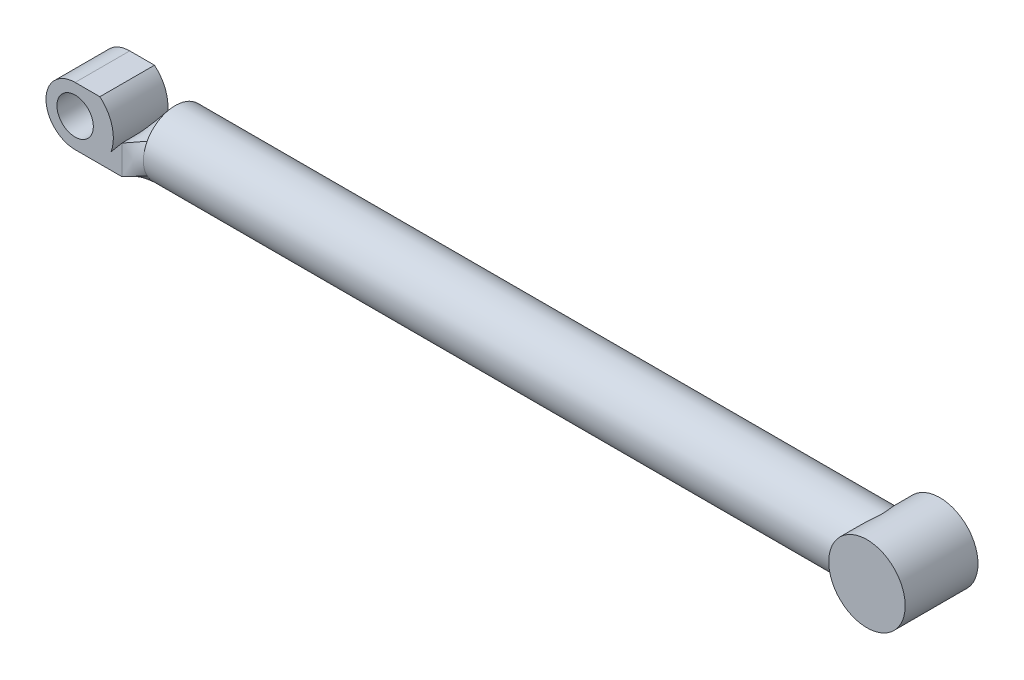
ISO-10303-21;
HEADER;
FILE_DESCRIPTION(('STEP AP214'),'2;1');
FILE_NAME('part.step','',(''),(''),'','','');
FILE_SCHEMA(('AUTOMOTIVE_DESIGN { 1 0 10303 214 1 1 1 1 }'));
ENDSEC;
DATA;
#1=APPLICATION_CONTEXT('core data for automotive mechanical design processes');
#2=APPLICATION_PROTOCOL_DEFINITION('international standard','automotive_design',2000,#1);
#3=PRODUCT_CONTEXT('',#1,'mechanical');
#4=PRODUCT('Part','Part','',(#3));
#5=PRODUCT_RELATED_PRODUCT_CATEGORY('part','',(#4));
#6=PRODUCT_DEFINITION_FORMATION('','',#4);
#7=PRODUCT_DEFINITION_CONTEXT('part definition',#1,'design');
#8=PRODUCT_DEFINITION('design','',#6,#7);
#9=PRODUCT_DEFINITION_SHAPE('','',#8);
#10=(LENGTH_UNIT() NAMED_UNIT(*) SI_UNIT(.MILLI.,.METRE.));
#11=(NAMED_UNIT(*) PLANE_ANGLE_UNIT() SI_UNIT($,.RADIAN.));
#12=(NAMED_UNIT(*) SI_UNIT($,.STERADIAN.) SOLID_ANGLE_UNIT());
#13=UNCERTAINTY_MEASURE_WITH_UNIT(LENGTH_MEASURE(1.E-05),#10,'distance_accuracy_value','');
#14=(GEOMETRIC_REPRESENTATION_CONTEXT(3) GLOBAL_UNCERTAINTY_ASSIGNED_CONTEXT((#13)) GLOBAL_UNIT_ASSIGNED_CONTEXT((#10,
#11,#12)) REPRESENTATION_CONTEXT('',''));
#15=CARTESIAN_POINT('',(0.,0.,0.));
#16=DIRECTION('',(0.,0.,1.));
#17=DIRECTION('',(1.,0.,0.));
#18=AXIS2_PLACEMENT_3D('',#15,#16,#17);
#19=CARTESIAN_POINT('',(4400.,0.,0.));
#20=DIRECTION('',(-1.,0.,0.));
#21=DIRECTION('',(0.,0.,1.));
#22=AXIS2_PLACEMENT_3D('',#19,#20,#21);
#23=CYLINDRICAL_SURFACE('',#22,175.);
#24=CARTESIAN_POINT('',(400.,82.3529411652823,-154.411764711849));
#25=CARTESIAN_POINT('',(400.000030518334,84.5244325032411,-153.253673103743));
#26=CARTESIAN_POINT('',(400.000038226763,86.6714593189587,-152.049721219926));
#27=CARTESIAN_POINT('',(400.000033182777,90.912753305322,-149.552413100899));
#28=CARTESIAN_POINT('',(400.000020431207,93.0070226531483,-148.259060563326));
#29=CARTESIAN_POINT('',(399.9999996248,97.1391018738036,-145.585203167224));
#30=CARTESIAN_POINT('',(399.999991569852,99.1769130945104,-144.2047003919));
#31=CARTESIAN_POINT('',(400.000064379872,103.192473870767,-141.359007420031));
#32=CARTESIAN_POINT('',(400.000145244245,105.170223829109,-139.893817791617));
#33=CARTESIAN_POINT('',(400.000165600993,109.060865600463,-136.882337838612));
#34=CARTESIAN_POINT('',(400.000105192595,110.973801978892,-135.336105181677));
#35=CARTESIAN_POINT('',(400.000024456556,113.792934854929,-132.957437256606));
#36=CARTESIAN_POINT('',(399.999999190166,114.724288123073,-132.154642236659));
#37=CARTESIAN_POINT('',(400.00000310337,116.569871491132,-130.529601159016));
#38=CARTESIAN_POINT('',(400.000032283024,117.484101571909,-129.707355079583));
#39=CARTESIAN_POINT('',(400.000142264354,120.200453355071,-127.212016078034));
#40=CARTESIAN_POINT('',(400.000245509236,121.976353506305,-125.51022374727));
#41=CARTESIAN_POINT('',(400.000261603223,125.454829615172,-122.033327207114));
#42=CARTESIAN_POINT('',(400.000174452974,127.157405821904,-120.258223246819));
#43=CARTESIAN_POINT('',(400.000037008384,129.931885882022,-117.240758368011));
#44=CARTESIAN_POINT('',(399.99998410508,131.025005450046,-116.017835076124));
#45=CARTESIAN_POINT('',(400.000019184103,133.176470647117,-113.541699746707));
#46=CARTESIAN_POINT('',(400.000107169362,134.234815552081,-112.288487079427));
#47=CARTESIAN_POINT('',(400.000256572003,136.315856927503,-109.752801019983));
#48=CARTESIAN_POINT('',(400.00031798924,137.338553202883,-108.470327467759));
#49=CARTESIAN_POINT('',(400.000353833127,139.347482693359,-105.877141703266));
#50=CARTESIAN_POINT('',(400.000328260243,140.333716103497,-104.566429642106));
#51=CARTESIAN_POINT('',(400.000219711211,142.268947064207,-101.917794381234));
#52=CARTESIAN_POINT('',(400.000136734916,143.217944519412,-100.579871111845));
#53=CARTESIAN_POINT('',(400.000018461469,145.077951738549,-97.8778730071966));
#54=CARTESIAN_POINT('',(399.999983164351,145.988961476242,-96.5137981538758));
#55=CARTESIAN_POINT('',(400.000061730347,147.772097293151,-93.7608463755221));
#56=CARTESIAN_POINT('',(400.000175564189,148.644230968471,-92.3719743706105));
#57=CARTESIAN_POINT('',(400.000347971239,150.349117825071,-89.5702620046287));
#58=CARTESIAN_POINT('',(400.000406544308,151.181870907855,-88.1574215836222));
#59=CARTESIAN_POINT('',(400.000429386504,152.807337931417,-85.3088890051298));
#60=CARTESIAN_POINT('',(400.000393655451,153.600051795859,-83.8731968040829));
#61=CARTESIAN_POINT('',(400.000258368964,155.144803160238,-80.9801153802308));
#62=CARTESIAN_POINT('',(400.000158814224,155.896841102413,-79.522726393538));
#63=CARTESIAN_POINT('',(400.00002078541,157.359644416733,-76.5874087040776));
#64=CARTESIAN_POINT('',(399.999982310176,158.070410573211,-75.1094803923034));
#65=CARTESIAN_POINT('',(400.000068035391,159.450142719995,-72.1341892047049));
#66=CARTESIAN_POINT('',(400.000192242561,160.119106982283,-70.6368255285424));
#67=CARTESIAN_POINT('',(400.000432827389,161.738545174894,-66.8707140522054));
#68=CARTESIAN_POINT('',(400.000514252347,162.662573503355,-64.5905389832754));
#69=CARTESIAN_POINT('',(400.000435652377,164.413747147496,-59.9930894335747));
#70=CARTESIAN_POINT('',(400.000275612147,165.240886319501,-57.6758126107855));
#71=CARTESIAN_POINT('',(400.000072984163,166.407729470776,-54.1754615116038));
#72=CARTESIAN_POINT('',(400.000011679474,166.784372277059,-53.0045841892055));
#73=CARTESIAN_POINT('',(399.999993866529,167.5128959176,-50.6551306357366));
#74=CARTESIAN_POINT('',(400.000037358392,167.864776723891,-49.4765543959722));
#75=CARTESIAN_POINT('',(400.000169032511,168.543604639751,-47.1122697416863));
#76=CARTESIAN_POINT('',(400.000257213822,168.870552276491,-45.9265614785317));
#77=CARTESIAN_POINT('',(400.000407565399,169.499374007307,-43.5485355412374));
#78=CARTESIAN_POINT('',(400.000469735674,169.801248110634,-42.3562178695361));
#79=CARTESIAN_POINT('',(400.00056869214,170.669140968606,-38.7697746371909));
#80=CARTESIAN_POINT('',(400.000517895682,171.197366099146,-36.366382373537));
#81=CARTESIAN_POINT('',(400.000242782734,172.152007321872,-31.5394919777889));
#82=CARTESIAN_POINT('',(400.00001846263,172.578421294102,-29.11599342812));
#83=CARTESIAN_POINT('',(399.999989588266,173.328702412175,-24.2531153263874));
#84=CARTESIAN_POINT('',(400.000185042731,173.652567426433,-21.8137354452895));
#85=CARTESIAN_POINT('',(400.000481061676,174.197140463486,-16.9235943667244));
#86=CARTESIAN_POINT('',(400.000581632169,174.417855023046,-14.4728339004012));
#87=CARTESIAN_POINT('',(400.000530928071,174.699447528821,-10.3823639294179));
#88=CARTESIAN_POINT('',(400.000452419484,174.789079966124,-8.74457584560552));
#89=CARTESIAN_POINT('',(400.000242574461,174.922267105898,-5.46717032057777));
#90=CARTESIAN_POINT('',(400.000111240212,174.96582371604,-3.8275529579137));
#91=CARTESIAN_POINT('',(399.999992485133,175.006828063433,-0.547719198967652));
#92=CARTESIAN_POINT('',(400.000005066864,175.004274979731,1.09249720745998));
#93=CARTESIAN_POINT('',(400.000149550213,174.953060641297,4.3722301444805));
#94=CARTESIAN_POINT('',(400.000281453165,174.904398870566,6.01174666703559));
#95=CARTESIAN_POINT('',(400.000479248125,174.761005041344,9.28875355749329));
#96=CARTESIAN_POINT('',(400.000545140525,174.666273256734,10.9262439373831));
#97=CARTESIAN_POINT('',(400.000569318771,174.430814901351,14.1979085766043));
#98=CARTESIAN_POINT('',(400.000527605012,174.290088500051,15.832082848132));
#99=CARTESIAN_POINT('',(400.000359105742,173.962767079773,19.0956794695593));
#100=CARTESIAN_POINT('',(400.000232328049,173.776176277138,20.7251022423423));
#101=CARTESIAN_POINT('',(400.000045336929,173.357266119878,23.9780650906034));
#102=CARTESIAN_POINT('',(399.999985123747,173.124946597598,25.6016051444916));
#103=CARTESIAN_POINT('',(400.000043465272,172.614763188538,28.8415126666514));
#104=CARTESIAN_POINT('',(400.000162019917,172.336899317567,30.4578801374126));
#105=CARTESIAN_POINT('',(400.000371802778,171.735846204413,33.6821681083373));
#106=CARTESIAN_POINT('',(400.000463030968,171.41265691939,35.2900886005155));
#107=CARTESIAN_POINT('',(400.00054763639,170.721218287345,38.4961664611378));
#108=CARTESIAN_POINT('',(400.000541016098,170.352970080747,40.0943240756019));
#109=CARTESIAN_POINT('',(400.000431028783,169.571678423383,43.2797326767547));
#110=CARTESIAN_POINT('',(400.000327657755,169.158633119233,44.8669832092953));
#111=CARTESIAN_POINT('',(400.00013995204,168.396957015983,47.6337830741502));
#112=CARTESIAN_POINT('',(400.000057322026,168.058051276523,48.8160182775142));
#113=CARTESIAN_POINT('',(399.999990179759,167.355394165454,51.1730842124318));
#114=CARTESIAN_POINT('',(400.000005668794,166.991642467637,52.3479148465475));
#115=CARTESIAN_POINT('',(400.000134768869,165.863316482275,55.8606247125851));
#116=CARTESIAN_POINT('',(400.000331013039,165.061672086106,58.1867190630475));
#117=CARTESIAN_POINT('',(400.000516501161,163.36108021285,62.8029324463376));
#118=CARTESIAN_POINT('',(400.000505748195,162.462134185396,65.0930520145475));
#119=CARTESIAN_POINT('',(400.000271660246,160.568513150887,69.6333406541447));
#120=CARTESIAN_POINT('',(400.00004832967,159.573840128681,71.8835105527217));
#121=CARTESIAN_POINT('',(399.999972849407,157.490267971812,76.340479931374));
#122=CARTESIAN_POINT('',(400.000120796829,156.401344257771,78.5472679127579));
#123=CARTESIAN_POINT('',(400.000355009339,154.13134946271,82.913086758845));
#124=CARTESIAN_POINT('',(400.000441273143,152.950276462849,85.0721166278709));
#125=CARTESIAN_POINT('',(400.000398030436,151.111272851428,88.2717223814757));
#126=CARTESIAN_POINT('',(400.000354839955,150.487023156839,89.3317933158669));
#127=CARTESIAN_POINT('',(400.000236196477,149.216296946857,91.4385580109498));
#128=CARTESIAN_POINT('',(400.00016074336,148.569820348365,92.4852517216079));
#129=CARTESIAN_POINT('',(400.000042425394,147.2549784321,94.5647106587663));
#130=CARTESIAN_POINT('',(399.999999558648,146.586614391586,95.597476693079));
#131=CARTESIAN_POINT('',(400.000002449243,145.228273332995,97.648665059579));
#132=CARTESIAN_POINT('',(400.000048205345,144.538296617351,98.6670875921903));
#133=CARTESIAN_POINT('',(400.000166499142,142.90299801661,101.026855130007));
#134=CARTESIAN_POINT('',(400.000242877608,141.949357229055,102.362453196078));
#135=CARTESIAN_POINT('',(400.000339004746,140.004981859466,105.006181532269));
#136=CARTESIAN_POINT('',(400.000358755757,139.014248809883,106.314312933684));
#137=CARTESIAN_POINT('',(400.000268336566,135.987276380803,110.196309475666));
#138=CARTESIAN_POINT('',(400.000008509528,133.896178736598,112.727899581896));
#139=CARTESIAN_POINT('',(399.999996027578,130.655522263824,116.433800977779));
#140=CARTESIAN_POINT('',(400.000054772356,129.557833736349,117.653991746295));
#141=CARTESIAN_POINT('',(400.000165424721,127.328579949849,120.063004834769));
#142=CARTESIAN_POINT('',(400.000217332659,126.197016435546,121.251828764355));
#143=CARTESIAN_POINT('',(400.000263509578,123.902114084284,123.595929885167));
#144=CARTESIAN_POINT('',(400.000257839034,122.73880986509,124.751240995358));
#145=CARTESIAN_POINT('',(400.000172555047,120.380197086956,127.028719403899));
#146=CARTESIAN_POINT('',(400.000092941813,119.184888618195,128.150886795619));
#147=CARTESIAN_POINT('',(400.000006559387,116.763359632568,130.361055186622));
#148=CARTESIAN_POINT('',(399.999999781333,115.537142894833,131.449060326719));
#149=CARTESIAN_POINT('',(400.000036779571,113.054607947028,133.590203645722));
#150=CARTESIAN_POINT('',(400.000080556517,111.798289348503,134.643341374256));
#151=CARTESIAN_POINT('',(400.000143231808,109.257101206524,136.713461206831));
#152=CARTESIAN_POINT('',(400.000162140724,107.972244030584,137.730458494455));
#153=CARTESIAN_POINT('',(400.000146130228,105.374530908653,139.727923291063));
#154=CARTESIAN_POINT('',(400.000111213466,104.061676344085,140.708392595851));
#155=CARTESIAN_POINT('',(400.000043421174,101.652235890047,142.455652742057));
#156=CARTESIAN_POINT('',(400.000011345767,100.56014589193,143.228653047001));
#157=CARTESIAN_POINT('',(399.999988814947,98.3587499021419,144.74925043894));
#158=CARTESIAN_POINT('',(399.999998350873,97.2494475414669,145.496852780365));
#159=CARTESIAN_POINT('',(400.000012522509,95.0141103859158,146.966348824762));
#160=CARTESIAN_POINT('',(400.000017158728,93.8880773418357,147.688245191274));
#161=CARTESIAN_POINT('',(400.000028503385,91.6218076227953,149.104750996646));
#162=CARTESIAN_POINT('',(400.00003520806,90.4816003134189,149.799407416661));
#163=CARTESIAN_POINT('',(400.000036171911,88.1854694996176,151.162514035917));
#164=CARTESIAN_POINT('',(400.000030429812,87.0295443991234,151.830961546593));
#165=CARTESIAN_POINT('',(400.000015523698,84.7024608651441,153.141362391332));
#166=CARTESIAN_POINT('',(400.000006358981,83.5312993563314,153.783310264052));
#167=CARTESIAN_POINT('',(400.,82.3529411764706,154.411764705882));
#168=B_SPLINE_CURVE_WITH_KNOTS('',3,(#24,#25,#26,#27,#28,#29,#30,#31,#32,#33,#34,#35,#36,#37,
#38,#39,#40,#41,#42,#43,#44,#45,#46,#47,#48,#49,#50,#51,#52,#53,#54,#55,#56,#57,#58,#59,#60,#61,
#62,#63,#64,#65,#66,#67,#68,#69,#70,#71,#72,#73,#74,#75,#76,#77,#78,#79,#80,#81,#82,#83,#84,#85,
#86,#87,#88,#89,#90,#91,#92,#93,#94,#95,#96,#97,#98,#99,#100,#101,#102,#103,#104,#105,#106,#107,
#108,#109,#110,#111,#112,#113,#114,#115,#116,#117,#118,#119,#120,#121,#122,#123,#124,#125,#126,
#127,#128,#129,#130,#131,#132,#133,#134,#135,#136,#137,#138,#139,#140,#141,#142,#143,#144,#145,
#146,#147,#148,#149,#150,#151,#152,#153,#154,#155,#156,#157,#158,#159,#160,#161,#162,#163,#164,
#165,#166,#167),.UNSPECIFIED.,.F.,.F.,(4,2,2,2,2,2,2,2,2,2,2,2,2,2,2,2,2,2,2,2,2,2,2,2,2,2,2,2,
2,2,2,2,2,2,2,2,2,2,2,2,2,2,2,2,2,2,2,2,2,2,2,2,2,2,2,2,2,2,2,2,2,2,2,2,2,2,2,2,2,2,2,4),(0.,
7.38246133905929,14.7646175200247,22.1465973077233,29.5285275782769,36.9052745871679,
40.5938184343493,44.2823664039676,51.6590038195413,59.035616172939,63.9557989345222,
68.876084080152,73.796396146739,78.7166818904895,83.636980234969,88.5572819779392,
93.476618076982,98.395966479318,103.315324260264,108.234628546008,113.153839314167,
118.073253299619,125.451858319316,132.830930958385,136.520598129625,140.21026946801,
143.899862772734,147.589454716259,154.969335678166,162.349370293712,169.72955830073,
177.109278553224,182.029405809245,186.949329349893,191.869340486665,196.789406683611,
201.709443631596,206.629462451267,211.549029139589,216.46861386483,221.388196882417,
226.307784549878,231.227247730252,236.146914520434,239.836202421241,243.525538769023,
250.904220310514,258.282791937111,265.661210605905,273.041559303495,280.422061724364,
284.112493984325,287.80294004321,291.493171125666,295.183350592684,300.105966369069,
305.028378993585,314.872757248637,319.796100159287,324.719189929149,329.637109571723,
334.555015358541,339.472322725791,344.389693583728,349.304973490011,354.220011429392,
358.233613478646,362.246380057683,366.258729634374,370.263823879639,374.269327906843,
378.275653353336),.UNSPECIFIED.);
#169=CARTESIAN_POINT('',(400.,82.3534192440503,-154.41266110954));
#170=VERTEX_POINT('',#169);
#171=CARTESIAN_POINT('',(400.,82.3534208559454,154.412664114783));
#172=VERTEX_POINT('',#171);
#173=EDGE_CURVE('E78',#170,#172,#168,.T.);
#174=ORIENTED_EDGE('',*,*,#173,.T.);
#175=CARTESIAN_POINT('',(400.,0.,0.));
#176=DIRECTION('',(1.,0.,0.));
#177=DIRECTION('',(0.,0.,-1.));
#178=AXIS2_PLACEMENT_3D('',#175,#176,#177);
#179=CIRCLE('',#178,175.);
#180=CARTESIAN_POINT('',(400.,-82.3534206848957,154.412663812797));
#181=VERTEX_POINT('',#180);
#182=EDGE_CURVE('E352',#172,#181,#179,.T.);
#183=ORIENTED_EDGE('',*,*,#182,.T.);
#184=CARTESIAN_POINT('',(400.,-82.3534208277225,-154.412664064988));
#185=VERTEX_POINT('',#184);
#186=EDGE_CURVE('E351',#181,#185,#179,.T.);
#187=ORIENTED_EDGE('',*,*,#186,.T.);
#188=EDGE_CURVE('E85',#185,#170,#179,.T.);
#189=ORIENTED_EDGE('',*,*,#188,.T.);
#190=EDGE_LOOP('',(#174,#183,#187,#189));
#191=FACE_BOUND('',#190,.T.);
#192=CARTESIAN_POINT('',(4190.,0.,175.));
#193=CARTESIAN_POINT('',(4190.00000143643,-2.07851005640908,174.999998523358));
#194=CARTESIAN_POINT('',(4190.03087510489,-4.15706454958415,174.962953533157));
#195=CARTESIAN_POINT('',(4190.15419110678,-8.30974612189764,174.814945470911));
#196=CARTESIAN_POINT('',(4190.24663533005,-10.3838730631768,174.703980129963));
#197=CARTESIAN_POINT('',(4190.49255729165,-14.5234631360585,174.408644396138));
#198=CARTESIAN_POINT('',(4190.64604092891,-16.5889254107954,174.224266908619));
#199=CARTESIAN_POINT('',(4191.01314398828,-20.7066833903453,173.782970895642));
#200=CARTESIAN_POINT('',(4191.2267629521,-22.7589791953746,173.526052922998));
#201=CARTESIAN_POINT('',(4191.71305522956,-26.8475198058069,172.940677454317));
#202=CARTESIAN_POINT('',(4191.98576288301,-28.8837545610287,172.612178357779));
#203=CARTESIAN_POINT('',(4192.58863662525,-32.9350973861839,171.885179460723));
#204=CARTESIAN_POINT('',(4192.91880287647,-34.9502053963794,171.486679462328));
#205=CARTESIAN_POINT('',(4193.63479706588,-38.9556420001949,170.621382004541));
#206=CARTESIAN_POINT('',(4194.02062368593,-40.9459711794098,170.154586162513));
#207=CARTESIAN_POINT('',(4194.8459305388,-44.8985962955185,169.154579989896));
#208=CARTESIAN_POINT('',(4195.28541071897,-46.8608922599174,168.621369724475));
#209=CARTESIAN_POINT('',(4196.21299296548,-50.742621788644,167.494018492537));
#210=CARTESIAN_POINT('',(4196.70078303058,-52.6622434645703,166.900267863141));
#211=CARTESIAN_POINT('',(4197.72488288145,-56.4682267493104,165.651292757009));
#212=CARTESIAN_POINT('',(4198.26119259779,-58.3545884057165,164.996068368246));
#213=CARTESIAN_POINT('',(4199.37986751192,-62.0915966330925,163.626384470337));
#214=CARTESIAN_POINT('',(4199.96222893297,-63.9422461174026,162.911929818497));
#215=CARTESIAN_POINT('',(4201.17060100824,-67.6061504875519,161.425886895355));
#216=CARTESIAN_POINT('',(4201.79661548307,-69.4194020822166,160.654293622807));
#217=CARTESIAN_POINT('',(4203.08971551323,-73.006678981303,159.056218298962));
#218=CARTESIAN_POINT('',(4203.75680211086,-74.7807032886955,158.229734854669));
#219=CARTESIAN_POINT('',(4205.12951512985,-78.2881934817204,156.52399878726));
#220=CARTESIAN_POINT('',(4205.83514502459,-80.0216556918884,155.644741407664));
#221=CARTESIAN_POINT('',(4207.28233833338,-83.4467458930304,153.835599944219));
#222=CARTESIAN_POINT('',(4208.02390332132,-85.1383720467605,152.905713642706));
#223=CARTESIAN_POINT('',(4209.54036766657,-88.4787733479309,150.997374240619));
#224=CARTESIAN_POINT('',(4210.3152682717,-90.1275468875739,150.018919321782));
#225=CARTESIAN_POINT('',(4212.18628097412,-93.9793815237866,147.647222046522));
#226=CARTESIAN_POINT('',(4213.29579172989,-96.1634889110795,146.233681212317));
#227=CARTESIAN_POINT('',(4215.56587537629,-100.448661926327,143.324019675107));
#228=CARTESIAN_POINT('',(4216.72645187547,-102.549721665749,141.827893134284));
#229=CARTESIAN_POINT('',(4219.09253543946,-106.668322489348,138.756871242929));
#230=CARTESIAN_POINT('',(4220.29805499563,-108.685840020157,137.181953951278));
#231=CARTESIAN_POINT('',(4222.74732595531,-112.636097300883,133.957493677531));
#232=CARTESIAN_POINT('',(4223.99107667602,-114.568838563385,132.307952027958));
#233=CARTESIAN_POINT('',(4226.51364987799,-118.354011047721,128.933212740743));
#234=CARTESIAN_POINT('',(4227.79255226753,-120.206229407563,127.207836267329));
#235=CARTESIAN_POINT('',(4230.37603493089,-123.82509075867,123.687988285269));
#236=CARTESIAN_POINT('',(4231.68061533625,-125.591733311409,121.893516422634));
#237=CARTESIAN_POINT('',(4234.30874466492,-129.039161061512,118.237921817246));
#238=CARTESIAN_POINT('',(4235.63229082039,-130.719958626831,116.376808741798));
#239=CARTESIAN_POINT('',(4238.29182229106,-133.995957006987,112.589311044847));
#240=CARTESIAN_POINT('',(4239.62780761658,-135.591157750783,110.662926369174));
#241=CARTESIAN_POINT('',(4242.32981699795,-138.724443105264,106.709917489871));
#242=CARTESIAN_POINT('',(4243.69594152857,-140.260937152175,104.682101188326));
#243=CARTESIAN_POINT('',(4246.42588199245,-143.244822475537,100.560399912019));
#244=CARTESIAN_POINT('',(4247.78969790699,-144.692213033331,98.4665144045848));
#245=CARTESIAN_POINT('',(4250.50686323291,-147.497853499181,94.2118835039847));
#246=CARTESIAN_POINT('',(4251.86020883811,-148.856072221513,92.0511151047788));
#247=CARTESIAN_POINT('',(4254.54637901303,-151.481917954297,87.662801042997));
#248=CARTESIAN_POINT('',(4255.87920383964,-152.749546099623,85.43525621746));
#249=CARTESIAN_POINT('',(4258.51045400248,-155.189948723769,80.9175843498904));
#250=CARTESIAN_POINT('',(4259.80895366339,-156.362941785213,78.6276188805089));
#251=CARTESIAN_POINT('',(4262.36271353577,-158.615497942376,73.9783525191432));
#252=CARTESIAN_POINT('',(4263.61797144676,-159.695056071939,71.6190479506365));
#253=CARTESIAN_POINT('',(4266.07026016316,-161.757192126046,66.8311312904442));
#254=CARTESIAN_POINT('',(4267.26733179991,-162.739838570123,64.4025697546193));
#255=CARTESIAN_POINT('',(4269.58777228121,-164.605183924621,59.4733207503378));
#256=CARTESIAN_POINT('',(4270.71115458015,-165.487901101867,56.9726465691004));
#257=CARTESIAN_POINT('',(4272.96728216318,-167.227100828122,51.6587982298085));
#258=CARTESIAN_POINT('',(4274.09095473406,-168.073292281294,48.8383658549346));
#259=CARTESIAN_POINT('',(4276.20020732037,-169.632935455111,43.1100096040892));
#260=CARTESIAN_POINT('',(4277.18580599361,-170.346405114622,40.2020976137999));
#261=CARTESIAN_POINT('',(4278.53659061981,-171.309502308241,35.7816149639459));
#262=CARTESIAN_POINT('',(4278.96524749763,-171.612453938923,34.2997413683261));
#263=CARTESIAN_POINT('',(4279.77659049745,-172.181814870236,31.3165731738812));
#264=CARTESIAN_POINT('',(4280.15928125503,-172.448227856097,29.8152805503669));
#265=CARTESIAN_POINT('',(4280.8748977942,-172.94334184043,26.7944675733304));
#266=CARTESIAN_POINT('',(4281.20781658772,-173.172037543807,25.2749446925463));
#267=CARTESIAN_POINT('',(4281.82010315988,-173.590465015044,22.2199689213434));
#268=CARTESIAN_POINT('',(4282.09947709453,-173.78020126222,20.6845178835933));
#269=CARTESIAN_POINT('',(4282.60452635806,-174.121787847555,17.5804315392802));
#270=CARTESIAN_POINT('',(4282.82947882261,-174.273129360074,16.011622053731));
#271=CARTESIAN_POINT('',(4283.21809106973,-174.533780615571,12.8629264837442));
#272=CARTESIAN_POINT('',(4283.38175090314,-174.643090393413,11.2830404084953));
#273=CARTESIAN_POINT('',(4283.64548137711,-174.818909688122,8.11568375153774));
#274=CARTESIAN_POINT('',(4283.7455564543,-174.88542219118,6.5282137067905));
#275=CARTESIAN_POINT('',(4283.88068255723,-174.975171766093,3.34927564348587));
#276=CARTESIAN_POINT('',(4283.91573362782,-174.998408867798,1.75780762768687));
#277=CARTESIAN_POINT('',(4283.92029289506,-175.001433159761,-1.42527088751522));
#278=CARTESIAN_POINT('',(4283.88980081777,-174.981220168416,-3.01688138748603));
#279=CARTESIAN_POINT('',(4283.76372537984,-174.897496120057,-6.19636387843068));
#280=CARTESIAN_POINT('',(4283.66814218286,-174.83398517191,-7.78423587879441));
#281=CARTESIAN_POINT('',(4283.41326225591,-174.664123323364,-10.9526837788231));
#282=CARTESIAN_POINT('',(4283.25395964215,-174.557768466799,-12.5332589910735));
#283=CARTESIAN_POINT('',(4282.87387561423,-174.302963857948,-15.6835700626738));
#284=CARTESIAN_POINT('',(4282.65309316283,-174.154513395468,-17.2533057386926));
#285=CARTESIAN_POINT('',(4282.13223058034,-173.802461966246,-20.5085835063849));
#286=CARTESIAN_POINT('',(4281.82709208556,-173.595307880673,-22.1929316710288));
#287=CARTESIAN_POINT('',(4281.15256379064,-173.134206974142,-25.5422076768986));
#288=CARTESIAN_POINT('',(4280.78317238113,-172.880258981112,-27.2071350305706));
#289=CARTESIAN_POINT('',(4279.98501898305,-172.327130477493,-30.5151159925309));
#290=CARTESIAN_POINT('',(4279.55625517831,-172.0279485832,-32.1581689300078));
#291=CARTESIAN_POINT('',(4278.64446839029,-171.385956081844,-35.4206005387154));
#292=CARTESIAN_POINT('',(4278.16143881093,-171.043140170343,-37.0399763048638));
#293=CARTESIAN_POINT('',(4276.63602116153,-169.949685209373,-41.8690449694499));
#294=CARTESIAN_POINT('',(4275.51938361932,-169.135459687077,-45.041259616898));
#295=CARTESIAN_POINT('',(4273.1288768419,-167.349759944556,-51.2795427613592));
#296=CARTESIAN_POINT('',(4271.85499247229,-166.378270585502,-54.3456010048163));
#297=CARTESIAN_POINT('',(4269.45969429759,-164.502416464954,-59.7526076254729));
#298=CARTESIAN_POINT('',(4268.36073526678,-163.62527579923,-62.1130986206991));
#299=CARTESIAN_POINT('',(4266.10101643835,-161.781298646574,-66.768867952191));
#300=CARTESIAN_POINT('',(4264.94024877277,-160.814450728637,-69.0641379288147));
#301=CARTESIAN_POINT('',(4262.56995611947,-158.793608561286,-73.5917012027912));
#302=CARTESIAN_POINT('',(4261.36040796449,-157.739572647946,-75.8239636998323));
#303=CARTESIAN_POINT('',(4258.90483334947,-155.546981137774,-80.2258207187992));
#304=CARTESIAN_POINT('',(4257.65880823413,-154.408428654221,-82.3954175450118));
#305=CARTESIAN_POINT('',(4255.13881324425,-152.04677815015,-86.6761833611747));
#306=CARTESIAN_POINT('',(4253.86480815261,-150.823568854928,-88.7872701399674));
#307=CARTESIAN_POINT('',(4251.29956774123,-148.295061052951,-92.9489267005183));
#308=CARTESIAN_POINT('',(4250.00833231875,-146.989762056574,-94.999496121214));
#309=CARTESIAN_POINT('',(4247.41706703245,-144.298087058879,-99.0401620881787));
#310=CARTESIAN_POINT('',(4246.11703911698,-142.91172853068,-101.030271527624));
#311=CARTESIAN_POINT('',(4243.51531680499,-140.058102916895,-104.950490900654));
#312=CARTESIAN_POINT('',(4242.21362240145,-138.590835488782,-106.880600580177));
#313=CARTESIAN_POINT('',(4239.54739192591,-135.496666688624,-110.779816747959));
#314=CARTESIAN_POINT('',(4238.18313337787,-133.865429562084,-112.745675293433));
#315=CARTESIAN_POINT('',(4235.46782872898,-130.513664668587,-116.609277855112));
#316=CARTESIAN_POINT('',(4234.11678275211,-128.793136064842,-118.5070212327));
#317=CARTESIAN_POINT('',(4231.43482818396,-125.262517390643,-122.232931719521));
#318=CARTESIAN_POINT('',(4230.10392294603,-123.452412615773,-124.061087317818));
#319=CARTESIAN_POINT('',(4227.4694178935,-119.742947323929,-127.645124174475));
#320=CARTESIAN_POINT('',(4226.16581787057,-117.843587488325,-129.401005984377));
#321=CARTESIAN_POINT('',(4223.59512940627,-113.959358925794,-132.834373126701));
#322=CARTESIAN_POINT('',(4222.32797755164,-111.97465585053,-134.511998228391));
#323=CARTESIAN_POINT('',(4219.83440032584,-107.916763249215,-137.788871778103));
#324=CARTESIAN_POINT('',(4218.60797569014,-105.843572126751,-139.388118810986));
#325=CARTESIAN_POINT('',(4216.20301693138,-101.610010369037,-142.503724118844));
#326=CARTESIAN_POINT('',(4215.02446960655,-99.4496640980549,-144.020105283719));
#327=CARTESIAN_POINT('',(4212.72182046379,-95.0424319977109,-146.965847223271));
#328=CARTESIAN_POINT('',(4211.59771489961,-92.7955521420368,-148.395213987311));
#329=CARTESIAN_POINT('',(4209.67824291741,-88.7767040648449,-150.823674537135));
#330=CARTESIAN_POINT('',(4208.86969455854,-87.02292619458,-151.842527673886));
#331=CARTESIAN_POINT('',(4207.29065675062,-83.4679066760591,-153.825390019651));
#332=CARTESIAN_POINT('',(4206.52016577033,-81.6666669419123,-154.789401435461));
#333=CARTESIAN_POINT('',(4205.02033494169,-78.0180768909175,-156.660084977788));
#334=CARTESIAN_POINT('',(4204.29099146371,-76.1707306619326,-157.566762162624));
#335=CARTESIAN_POINT('',(4202.87641412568,-72.4312638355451,-159.320358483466));
#336=CARTESIAN_POINT('',(4202.1911806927,-70.5391428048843,-160.167277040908));
#337=CARTESIAN_POINT('',(4200.86810206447,-66.7126950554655,-161.798455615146));
#338=CARTESIAN_POINT('',(4200.2302393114,-64.7783843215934,-162.582738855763));
#339=CARTESIAN_POINT('',(4199.00459401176,-60.8690636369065,-164.086388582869));
#340=CARTESIAN_POINT('',(4198.41681128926,-58.8940538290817,-164.805755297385));
#341=CARTESIAN_POINT('',(4197.29419132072,-54.9057993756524,-166.177013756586));
#342=CARTESIAN_POINT('',(4196.7593561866,-52.8925532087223,-166.828902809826));
#343=CARTESIAN_POINT('',(4195.74542666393,-48.8308364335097,-168.06264978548));
#344=CARTESIAN_POINT('',(4195.26633237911,-46.782365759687,-168.644507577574));
#345=CARTESIAN_POINT('',(4194.3629857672,-42.6374516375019,-169.740031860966));
#346=CARTESIAN_POINT('',(4193.9391894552,-40.5407588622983,-170.25313217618));
#347=CARTESIAN_POINT('',(4193.15330102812,-36.3187791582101,-171.203470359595));
#348=CARTESIAN_POINT('',(4192.79120899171,-34.1934921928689,-171.640708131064));
#349=CARTESIAN_POINT('',(4192.13089785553,-29.9184615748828,-172.437273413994));
#350=CARTESIAN_POINT('',(4191.83268007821,-27.7687174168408,-172.79659931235));
#351=CARTESIAN_POINT('',(4191.3019822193,-23.4493479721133,-173.435562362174));
#352=CARTESIAN_POINT('',(4191.06950194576,-21.279722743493,-173.715199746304));
#353=CARTESIAN_POINT('',(4190.67186799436,-16.9265382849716,-174.193238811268));
#354=CARTESIAN_POINT('',(4190.50667943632,-14.7429868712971,-174.391682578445));
#355=CARTESIAN_POINT('',(4190.24453342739,-10.3658658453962,-174.706506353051));
#356=CARTESIAN_POINT('',(4190.14757647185,-8.17229616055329,-174.82288576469));
#357=CARTESIAN_POINT('',(4190.02254275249,-3.78057830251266,-174.972952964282));
#358=CARTESIAN_POINT('',(4189.99445950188,-1.58243058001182,-175.006648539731));
#359=CARTESIAN_POINT('',(4190.00734420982,2.81333049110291,-174.991187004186));
#360=CARTESIAN_POINT('',(4190.04831015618,5.01094385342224,-174.942032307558));
#361=CARTESIAN_POINT('',(4190.18996505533,9.13697699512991,-174.772001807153));
#362=CARTESIAN_POINT('',(4190.28289825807,11.0660577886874,-174.660439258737));
#363=CARTESIAN_POINT('',(4190.52153504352,14.91618346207,-174.37383289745));
#364=CARTESIAN_POINT('',(4190.66723722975,16.8372285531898,-174.198790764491));
#365=CARTESIAN_POINT('',(4191.01066088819,20.6676921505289,-173.785951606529));
#366=CARTESIAN_POINT('',(4191.20837746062,22.5771117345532,-173.548160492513));
#367=CARTESIAN_POINT('',(4191.65485730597,26.3812286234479,-173.010753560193));
#368=CARTESIAN_POINT('',(4191.90362095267,28.2759258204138,-172.711137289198));
#369=CARTESIAN_POINT('',(4192.45100026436,32.0475281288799,-172.05121695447));
#370=CARTESIAN_POINT('',(4192.74961787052,33.9244325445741,-171.690910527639));
#371=CARTESIAN_POINT('',(4193.39529243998,37.6574418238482,-170.910950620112));
#372=CARTESIAN_POINT('',(4193.74234930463,39.5135467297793,-170.49129726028));
#373=CARTESIAN_POINT('',(4194.4833360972,43.2023153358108,-169.594112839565));
#374=CARTESIAN_POINT('',(4194.87726764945,45.0349782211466,-169.116579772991));
#375=CARTESIAN_POINT('',(4195.7102669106,48.6743230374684,-168.105256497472));
#376=CARTESIAN_POINT('',(4196.14933474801,50.481004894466,-167.571466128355));
#377=CARTESIAN_POINT('',(4197.07685414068,54.0898667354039,-166.441906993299));
#378=CARTESIAN_POINT('',(4197.56588215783,55.8916709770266,-165.845411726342));
#379=CARTESIAN_POINT('',(4198.58639690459,59.4643791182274,-164.598201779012));
#380=CARTESIAN_POINT('',(4199.11788732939,61.2352803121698,-163.947482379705));
#381=CARTESIAN_POINT('',(4200.2211353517,64.7440086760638,-162.593814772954));
#382=CARTESIAN_POINT('',(4200.79288809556,66.481839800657,-161.890872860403));
#383=CARTESIAN_POINT('',(4201.97457275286,69.9231082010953,-160.434568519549));
#384=CARTESIAN_POINT('',(4202.58450760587,71.6265428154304,-159.681202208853));
#385=CARTESIAN_POINT('',(4204.46843986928,76.6834178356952,-157.348130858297));
#386=CARTESIAN_POINT('',(4205.79658848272,79.9835036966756,-155.695424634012));
#387=CARTESIAN_POINT('',(4208.57935343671,86.4318977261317,-152.210265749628));
#388=CARTESIAN_POINT('',(4210.03398663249,89.5801855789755,-150.377789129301));
#389=CARTESIAN_POINT('',(4212.63672932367,94.87440457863,-147.073878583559));
#390=CARTESIAN_POINT('',(4213.75906618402,97.0578058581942,-145.641817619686));
#391=CARTESIAN_POINT('',(4216.05446534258,101.34072881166,-142.694828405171));
#392=CARTESIAN_POINT('',(4217.22753175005,103.440243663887,-141.179893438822));
#393=CARTESIAN_POINT('',(4219.61814628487,107.554871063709,-138.071000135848));
#394=CARTESIAN_POINT('',(4220.83570864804,109.569956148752,-136.477016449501));
#395=CARTESIAN_POINT('',(4223.30849216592,113.514445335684,-133.214195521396));
#396=CARTESIAN_POINT('',(4224.56371254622,115.443851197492,-131.545359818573));
#397=CARTESIAN_POINT('',(4227.10898698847,119.222064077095,-128.131185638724));
#398=CARTESIAN_POINT('',(4228.3991292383,121.070628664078,-126.385644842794));
#399=CARTESIAN_POINT('',(4231.00432759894,124.681268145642,-122.825119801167));
#400=CARTESIAN_POINT('',(4232.319383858,126.443342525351,-121.01013514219));
#401=CARTESIAN_POINT('',(4234.96754829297,129.880699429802,-117.31314428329));
#402=CARTESIAN_POINT('',(4236.30065355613,131.555995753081,-115.431148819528));
#403=CARTESIAN_POINT('',(4238.97825531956,134.820078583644,-111.601419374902));
#404=CARTESIAN_POINT('',(4240.32275182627,136.408865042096,-109.653685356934));
#405=CARTESIAN_POINT('',(4243.04002562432,139.52748746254,-105.658022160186));
#406=CARTESIAN_POINT('',(4244.41287842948,141.055759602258,-103.608923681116));
#407=CARTESIAN_POINT('',(4247.15477461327,144.022277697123,-99.4440562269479));
#408=CARTESIAN_POINT('',(4248.52381795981,145.46052289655,-97.3282866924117));
#409=CARTESIAN_POINT('',(4251.24970142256,148.246917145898,-93.0291131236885));
#410=CARTESIAN_POINT('',(4252.60653676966,149.595032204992,-90.8456840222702));
#411=CARTESIAN_POINT('',(4255.29756793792,152.199579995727,-86.4112257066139));
#412=CARTESIAN_POINT('',(4256.63176406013,153.456013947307,-84.1601973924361));
#413=CARTESIAN_POINT('',(4259.26283849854,155.872489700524,-79.5953425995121));
#414=CARTESIAN_POINT('',(4260.55980689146,157.032779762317,-77.2816997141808));
#415=CARTESIAN_POINT('',(4263.10750056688,159.258609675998,-72.5840968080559));
#416=CARTESIAN_POINT('',(4264.35822322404,160.324144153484,-70.2001328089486));
#417=CARTESIAN_POINT('',(4266.79776568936,162.356654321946,-65.3620385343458));
#418=CARTESIAN_POINT('',(4267.98663215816,163.323704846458,-62.9079633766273));
#419=CARTESIAN_POINT('',(4270.28634394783,165.156073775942,-57.9267792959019));
#420=CARTESIAN_POINT('',(4271.39720452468,166.021412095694,-55.3996847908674));
#421=CARTESIAN_POINT('',(4273.60600950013,167.709992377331,-50.0678232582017));
#422=CARTESIAN_POINT('',(4274.69594605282,168.524456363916,-47.2569270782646));
#423=CARTESIAN_POINT('',(4276.73491443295,170.021527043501,-41.5497006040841));
#424=CARTESIAN_POINT('',(4277.68396567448,170.70415190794,-38.6533821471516));
#425=CARTESIAN_POINT('',(4278.9782208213,171.62170053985,-34.2524858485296));
#426=CARTESIAN_POINT('',(4279.3877567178,171.90959480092,-32.7775495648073));
#427=CARTESIAN_POINT('',(4280.1604113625,172.449108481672,-29.8090582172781));
#428=CARTESIAN_POINT('',(4280.52353482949,172.700731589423,-28.3155050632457));
#429=CARTESIAN_POINT('',(4281.19971200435,173.166567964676,-25.3110844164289));
#430=CARTESIAN_POINT('',(4281.51275890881,173.380776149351,-23.8002146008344));
#431=CARTESIAN_POINT('',(4282.08519262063,173.770590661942,-20.7635433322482));
#432=CARTESIAN_POINT('',(4282.34458557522,173.946201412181,-19.2377436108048));
#433=CARTESIAN_POINT('',(4282.80937339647,174.259681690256,-16.1552402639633));
#434=CARTESIAN_POINT('',(4283.01408716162,174.397075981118,-14.5983851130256));
#435=CARTESIAN_POINT('',(4283.36269267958,174.630417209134,-11.4747619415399));
#436=CARTESIAN_POINT('',(4283.50658447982,174.72636417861,-9.90799392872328));
#437=CARTESIAN_POINT('',(4283.7315421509,174.876139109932,-6.76802761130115));
#438=CARTESIAN_POINT('',(4283.81261204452,174.929969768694,-5.19482972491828));
#439=CARTESIAN_POINT('',(4283.9107788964,174.995132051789,-2.0455511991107));
#440=CARTESIAN_POINT('',(4283.92787585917,175.006463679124,-0.469470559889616));
#441=CARTESIAN_POINT('',(4283.8978448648,174.986542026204,2.68215161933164));
#442=CARTESIAN_POINT('',(4283.85070286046,174.955279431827,4.25769296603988));
#443=CARTESIAN_POINT('',(4283.69285249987,174.85038282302,7.40415313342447));
#444=CARTESIAN_POINT('',(4283.58214434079,174.776748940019,8.97507196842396));
#445=CARTESIAN_POINT('',(4283.29871379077,174.587624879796,12.1089102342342));
#446=CARTESIAN_POINT('',(4283.12598521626,174.472130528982,13.6718288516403));
#447=CARTESIAN_POINT('',(4282.72086459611,174.200068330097,16.7863021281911));
#448=CARTESIAN_POINT('',(4282.4884713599,174.043499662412,18.3378565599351));
#449=CARTESIAN_POINT('',(4281.93930118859,173.671508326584,21.5908354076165));
#450=CARTESIAN_POINT('',(4281.61618378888,173.451601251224,23.2906771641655));
#451=CARTESIAN_POINT('',(4280.90527856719,172.964253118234,26.6698656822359));
#452=CARTESIAN_POINT('',(4280.51748872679,172.696810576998,28.3492118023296));
#453=CARTESIAN_POINT('',(4279.68235940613,172.116018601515,31.6850520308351));
#454=CARTESIAN_POINT('',(4279.23501694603,171.802666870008,33.3415449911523));
#455=CARTESIAN_POINT('',(4278.28610248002,171.131718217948,36.6299315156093));
#456=CARTESIAN_POINT('',(4277.78452385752,170.774115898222,38.2618220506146));
#457=CARTESIAN_POINT('',(4276.20368937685,169.635377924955,43.1271695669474));
#458=CARTESIAN_POINT('',(4275.05049070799,168.789789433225,46.3218887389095));
#459=CARTESIAN_POINT('',(4272.58859297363,166.9392202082,52.6024868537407));
#460=CARTESIAN_POINT('',(4271.27988017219,165.934225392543,55.6883561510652));
#461=CARTESIAN_POINT('',(4268.82264868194,163.995207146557,61.1320336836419));
#462=CARTESIAN_POINT('',(4267.69608687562,163.088686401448,63.5096986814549));
#463=CARTESIAN_POINT('',(4265.38252326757,161.184302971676,68.1984193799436));
#464=CARTESIAN_POINT('',(4264.19551383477,160.186428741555,70.5094666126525));
#465=CARTESIAN_POINT('',(4261.77421780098,158.101824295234,75.0672759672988));
#466=CARTESIAN_POINT('',(4260.53990886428,157.015051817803,77.3140068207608));
#467=CARTESIAN_POINT('',(4258.03639950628,154.755225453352,81.7435117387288));
#468=CARTESIAN_POINT('',(4256.76720036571,153.582174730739,83.9262881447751));
#469=CARTESIAN_POINT('',(4254.20250876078,151.149659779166,88.2320954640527));
#470=CARTESIAN_POINT('',(4252.9069835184,149.890082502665,90.3550429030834));
#471=CARTESIAN_POINT('',(4250.30046585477,147.286938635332,94.5390297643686));
#472=CARTESIAN_POINT('',(4248.98947334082,145.943371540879,96.6000688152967));
#473=CARTESIAN_POINT('',(4246.36055695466,143.173206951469,100.660175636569));
#474=CARTESIAN_POINT('',(4245.04263462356,141.746627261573,102.659256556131));
#475=CARTESIAN_POINT('',(4242.40709514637,138.810547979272,106.595782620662));
#476=CARTESIAN_POINT('',(4241.08947800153,137.301048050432,108.533227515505));
#477=CARTESIAN_POINT('',(4238.39690596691,134.123033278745,112.439582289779));
#478=CARTESIAN_POINT('',(4237.02231718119,132.450349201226,114.405355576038));
#479=CARTESIAN_POINT('',(4234.28873571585,129.013942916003,118.266997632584));
#480=CARTESIAN_POINT('',(4232.9297431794,127.250219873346,120.16286576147));
#481=CARTESIAN_POINT('',(4230.23439747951,123.631433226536,123.88302364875));
#482=CARTESIAN_POINT('',(4228.89804834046,121.776353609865,125.707300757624));
#483=CARTESIAN_POINT('',(4226.2553372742,117.975210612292,129.281301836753));
#484=CARTESIAN_POINT('',(4224.94897510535,116.029147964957,131.031026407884));
#485=CARTESIAN_POINT('',(4222.37565836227,112.049973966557,134.449508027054));
#486=CARTESIAN_POINT('',(4221.10863430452,110.017033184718,136.118411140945));
#487=CARTESIAN_POINT('',(4218.6183721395,105.8611039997,139.375018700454));
#488=CARTESIAN_POINT('',(4217.39513490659,103.738113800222,140.962721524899));
#489=CARTESIAN_POINT('',(4214.99988258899,99.4036515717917,144.052055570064));
#490=CARTESIAN_POINT('',(4213.82785141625,97.1922077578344,145.553713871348));
#491=CARTESIAN_POINT('',(4211.54175401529,92.6816120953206,148.466578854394));
#492=CARTESIAN_POINT('',(4210.42768335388,90.3824669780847,149.877792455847));
#493=CARTESIAN_POINT('',(4208.54483642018,86.3051253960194,152.251297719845));
#494=CARTESIAN_POINT('',(4207.76136358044,84.5462371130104,153.235192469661));
#495=CARTESIAN_POINT('',(4206.23311690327,80.9824277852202,155.148109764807));
#496=CARTESIAN_POINT('',(4205.48834167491,79.1775083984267,156.077134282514));
#497=CARTESIAN_POINT('',(4204.04047955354,75.5230363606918,157.877864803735));
#498=CARTESIAN_POINT('',(4203.3373901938,73.6734863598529,158.749574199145));
#499=CARTESIAN_POINT('',(4201.9757919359,69.9312343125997,160.433263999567));
#500=CARTESIAN_POINT('',(4201.31728337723,68.0385319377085,161.245243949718));
#501=CARTESIAN_POINT('',(4200.04842209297,64.2138753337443,162.806142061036));
#502=CARTESIAN_POINT('',(4199.43802086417,62.2819631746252,163.555123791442));
#503=CARTESIAN_POINT('',(4198.26748955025,58.3793133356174,164.988414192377));
#504=CARTESIAN_POINT('',(4197.70735856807,56.4085763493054,165.672724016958));
#505=CARTESIAN_POINT('',(4196.64016209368,52.4310580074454,166.974136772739));
#506=CARTESIAN_POINT('',(4196.13309187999,50.4242798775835,167.591245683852));
#507=CARTESIAN_POINT('',(4195.17459595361,46.3775484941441,168.755905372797));
#508=CARTESIAN_POINT('',(4194.72316811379,44.3375965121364,169.303458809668));
#509=CARTESIAN_POINT('',(4193.95034804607,40.5779567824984,170.239585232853));
#510=CARTESIAN_POINT('',(4193.61990388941,38.8629032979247,170.639351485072));
#511=CARTESIAN_POINT('',(4193.00026967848,35.4144088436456,171.388251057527));
#512=CARTESIAN_POINT('',(4192.71107843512,33.6809684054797,171.737385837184));
#513=CARTESIAN_POINT('',(4192.17513152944,30.1981465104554,172.383898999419));
#514=CARTESIAN_POINT('',(4191.9283711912,28.4487668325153,172.681283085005));
#515=CARTESIAN_POINT('',(4191.47825886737,24.9362883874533,173.223379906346));
#516=CARTESIAN_POINT('',(4191.27490726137,23.1731895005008,173.468092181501));
#517=CARTESIAN_POINT('',(4190.91247914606,19.6359207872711,173.904013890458));
#518=CARTESIAN_POINT('',(4190.75340099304,17.861751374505,174.095225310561));
#519=CARTESIAN_POINT('',(4190.48019414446,14.3049730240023,174.423499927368));
#520=CARTESIAN_POINT('',(4190.36606504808,12.5223641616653,174.560563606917));
#521=CARTESIAN_POINT('',(4190.18324110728,8.95123435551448,174.780078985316));
#522=CARTESIAN_POINT('',(4190.1145518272,7.16271271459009,174.862523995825));
#523=CARTESIAN_POINT('',(4190.02293037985,3.58280507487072,174.972485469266));
#524=CARTESIAN_POINT('',(4189.99999876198,1.79141904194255,175.000001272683));
#525=CARTESIAN_POINT('',(4190.,0.,175.));
#526=B_SPLINE_CURVE_WITH_KNOTS('',3,(#192,#193,#194,#195,#196,#197,#198,#199,#200,#201,#202,
#203,#204,#205,#206,#207,#208,#209,#210,#211,#212,#213,#214,#215,#216,#217,#218,#219,#220,#221,
#222,#223,#224,#225,#226,#227,#228,#229,#230,#231,#232,#233,#234,#235,#236,#237,#238,#239,#240,
#241,#242,#243,#244,#245,#246,#247,#248,#249,#250,#251,#252,#253,#254,#255,#256,#257,#258,#259,
#260,#261,#262,#263,#264,#265,#266,#267,#268,#269,#270,#271,#272,#273,#274,#275,#276,#277,#278,
#279,#280,#281,#282,#283,#284,#285,#286,#287,#288,#289,#290,#291,#292,#293,#294,#295,#296,#297,
#298,#299,#300,#301,#302,#303,#304,#305,#306,#307,#308,#309,#310,#311,#312,#313,#314,#315,#316,
#317,#318,#319,#320,#321,#322,#323,#324,#325,#326,#327,#328,#329,#330,#331,#332,#333,#334,#335,
#336,#337,#338,#339,#340,#341,#342,#343,#344,#345,#346,#347,#348,#349,#350,#351,#352,#353,#354,
#355,#356,#357,#358,#359,#360,#361,#362,#363,#364,#365,#366,#367,#368,#369,#370,#371,#372,#373,
#374,#375,#376,#377,#378,#379,#380,#381,#382,#383,#384,#385,#386,#387,#388,#389,#390,#391,#392,
#393,#394,#395,#396,#397,#398,#399,#400,#401,#402,#403,#404,#405,#406,#407,#408,#409,#410,#411,
#412,#413,#414,#415,#416,#417,#418,#419,#420,#421,#422,#423,#424,#425,#426,#427,#428,#429,#430,
#431,#432,#433,#434,#435,#436,#437,#438,#439,#440,#441,#442,#443,#444,#445,#446,#447,#448,#449,
#450,#451,#452,#453,#454,#455,#456,#457,#458,#459,#460,#461,#462,#463,#464,#465,#466,#467,#468,
#469,#470,#471,#472,#473,#474,#475,#476,#477,#478,#479,#480,#481,#482,#483,#484,#485,#486,#487,
#488,#489,#490,#491,#492,#493,#494,#495,#496,#497,#498,#499,#500,#501,#502,#503,#504,#505,#506,
#507,#508,#509,#510,#511,#512,#513,#514,#515,#516,#517,#518,#519,#520,#521,#522,#523,#524,#525),
.UNSPECIFIED.,.T.,.F.,(4,2,2,2,2,2,2,2,2,2,2,2,2,2,2,2,2,2,2,2,2,2,2,2,2,2,2,2,2,2,2,2,2,2,2,2,
2,2,2,2,2,2,2,2,2,2,2,2,2,2,2,2,2,2,2,2,2,2,2,2,2,2,2,2,2,2,2,2,2,2,2,2,2,2,2,2,2,2,2,2,2,2,2,2,
2,2,2,2,2,2,2,2,2,2,2,2,2,2,2,2,2,2,2,2,2,2,2,2,2,2,2,2,2,2,2,2,2,2,2,2,2,2,2,2,2,2,2,2,2,2,2,2,
2,2,2,2,2,2,2,2,2,2,2,2,2,2,2,2,2,2,2,2,2,2,2,2,2,2,2,2,2,2,2,2,2,2,4),(0.,6.23504923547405,
12.4702898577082,18.7061332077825,24.9419290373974,31.181358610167,37.4208058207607,
43.6601052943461,49.8993986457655,56.1007415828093,62.3020756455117,68.5029016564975,
74.7042710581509,80.9057978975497,87.1078845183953,93.3102430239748,99.5128339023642,
107.994661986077,116.477090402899,124.961894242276,133.446546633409,141.95241133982,
150.458319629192,158.96299896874,167.467685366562,176.128825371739,184.790035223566,
193.454258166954,202.118372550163,210.761865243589,219.405817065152,228.043612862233,
236.679827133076,246.128984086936,255.576862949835,260.292137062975,265.00693525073,
269.722394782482,274.437311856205,279.21178501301,283.98625420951,288.760390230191,
293.534522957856,298.308675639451,303.082816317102,307.857397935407,312.632060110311,
317.802753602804,322.97357662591,328.144557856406,333.316168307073,343.68567273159,
354.05617595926,362.295791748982,370.536458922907,378.781087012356,387.025411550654,
395.280786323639,403.536210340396,411.789861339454,420.04354728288,428.72930947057,
437.41515307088,446.102427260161,454.789635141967,463.460681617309,472.131884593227,
480.800680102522,489.468878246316,496.017879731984,502.566617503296,509.11477670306,
515.662999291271,522.208782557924,528.754542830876,535.300564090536,541.846597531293,
548.443595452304,555.040601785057,561.637744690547,568.234868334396,574.828568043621,
581.422315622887,588.015442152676,594.608376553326,600.410246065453,606.211962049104,
612.013131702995,617.814343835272,623.615781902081,629.417208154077,635.218835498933,
641.020479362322,646.898873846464,652.777780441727,658.655979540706,664.53463174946,
676.291687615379,688.050312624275,696.573886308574,705.098151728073,713.625168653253,
722.152010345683,730.702878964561,739.253798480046,747.803354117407,756.35291458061,
765.055478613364,773.758115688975,782.464016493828,791.169801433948,799.852356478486,
808.535403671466,817.211802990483,825.886500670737,835.249008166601,844.61022430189,
849.281937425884,853.953175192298,858.625047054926,863.296383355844,868.023447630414,
872.750508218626,877.477266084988,882.204023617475,886.931814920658,891.659591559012,
896.387839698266,901.116182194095,906.34666777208,911.577316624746,916.808227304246,
922.039776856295,932.529226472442,943.019603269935,951.365092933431,959.711638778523,
968.062175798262,976.412406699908,984.773762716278,993.135168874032,1001.4947881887,
1009.85444142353,1018.62511712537,1027.39587328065,1036.16817223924,1044.94040048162,
1053.6961332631,1062.45204078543,1071.20517727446,1079.95764328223,1086.44315620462,
1092.92843585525,1099.4133313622,1105.89827624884,1112.37659688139,1118.85480188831,
1125.33242995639,1131.80981031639,1137.1838785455,1142.55779183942,1147.93111254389,
1153.30448023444,1158.67764840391,1164.05076865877,1169.42454675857,1174.79838937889),.UNSPECIFIED.);
#527=CARTESIAN_POINT('',(4190.,0.,175.));
#528=VERTEX_POINT('',#527);
#529=EDGE_CURVE('E12',#528,#528,#526,.T.);
#530=ORIENTED_EDGE('',*,*,#529,.F.);
#531=EDGE_LOOP('',(#530));
#532=FACE_BOUND('',#531,.T.);
#533=ADVANCED_FACE('F66',(#191,#532),#23,.T.);
#534=CARTESIAN_POINT('',(401.42664549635,83.1764705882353,154.455882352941));
#535=CARTESIAN_POINT('',(400.,82.3529411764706,154.411764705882));
#536=CARTESIAN_POINT('',(257.335450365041,0.,150.));
#537=CARTESIAN_POINT('',(401.42664549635,88.910142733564,151.460423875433));
#538=CARTESIAN_POINT('',(400.,88.0298442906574,151.384083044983));
#539=CARTESIAN_POINT('',(257.335450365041,0.,143.75));
#540=CARTESIAN_POINT('',(401.42664549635,94.6664622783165,148.046619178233));
#541=CARTESIAN_POINT('',(400.,93.7291705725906,147.942197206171));
#542=CARTESIAN_POINT('',(257.335450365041,0.,137.5));
#543=CARTESIAN_POINT('',(401.42664549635,106.071656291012,140.303393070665));
#544=CARTESIAN_POINT('',(400.,105.021441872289,140.151874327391));
#545=CARTESIAN_POINT('',(257.335450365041,0.,125.));
#546=CARTESIAN_POINT('',(401.42664549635,111.72039907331,135.973451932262));
#547=CARTESIAN_POINT('',(400.,110.614256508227,135.80292270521));
#548=CARTESIAN_POINT('',(257.335450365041,0.,118.75));
#549=CARTESIAN_POINT('',(401.42664549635,122.721388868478,126.350352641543));
#550=CARTESIAN_POINT('',(400.,121.506325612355,126.151339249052));
#551=CARTESIAN_POINT('',(257.335450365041,0.,106.25));
#552=CARTESIAN_POINT('',(401.42664549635,128.073268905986,121.056671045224));
#553=CARTESIAN_POINT('',(400.,126.8052167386,120.848189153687));
#554=CARTESIAN_POINT('',(257.335450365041,0.,100.));
#555=CARTESIAN_POINT('',(401.42664549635,138.26234753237,109.506685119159));
#556=CARTESIAN_POINT('',(400.,136.893413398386,109.288797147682));
#557=CARTESIAN_POINT('',(257.335450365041,0.,87.5));
#558=CARTESIAN_POINT('',(401.426645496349,143.098918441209,103.2499736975));
#559=CARTESIAN_POINT('',(400.,141.682097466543,103.032152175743));
#560=CARTESIAN_POINT('',(257.335450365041,0.,81.25));
#561=CARTESIAN_POINT('',(401.42664549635,152.024934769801,89.8371822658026));
#562=CARTESIAN_POINT('',(400.,150.519737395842,89.6283982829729));
#563=CARTESIAN_POINT('',(257.335450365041,0.,68.75));
#564=CARTESIAN_POINT('',(401.42664549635,156.113536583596,82.6809554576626));
#565=CARTESIAN_POINT('',(400.,154.567858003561,82.4811440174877));
#566=CARTESIAN_POINT('',(257.335450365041,0.,62.5));
#567=CARTESIAN_POINT('',(401.42664549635,163.319241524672,67.603919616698));
#568=CARTESIAN_POINT('',(400.,161.702219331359,67.4296233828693));
#569=CARTESIAN_POINT('',(257.335450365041,0.,50.));
#570=CARTESIAN_POINT('',(401.42664549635,166.435418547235,59.6833445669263));
#571=CARTESIAN_POINT('',(400.,164.787543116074,59.5255886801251));
#572=CARTESIAN_POINT('',(257.335450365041,0.,43.75));
#573=CARTESIAN_POINT('',(401.42664549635,171.507124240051,43.2830368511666));
#574=CARTESIAN_POINT('',(400.,169.809033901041,43.1638978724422));
#575=CARTESIAN_POINT('',(257.335450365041,0.,31.25));
#576=CARTESIAN_POINT('',(401.42664549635,173.461848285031,34.8039557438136));
#577=CARTESIAN_POINT('',(400.,171.744404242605,34.706886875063));
#578=CARTESIAN_POINT('',(257.335450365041,0.,25.));
#579=CARTESIAN_POINT('',(401.42664549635,176.083521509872,17.5494469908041));
#580=CARTESIAN_POINT('',(400.,174.340120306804,17.4994524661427));
#581=CARTESIAN_POINT('',(257.335450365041,0.,12.5));
#582=CARTESIAN_POINT('',(401.42664549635,176.75,8.77499999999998));
#583=CARTESIAN_POINT('',(400.,175.,8.74999999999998));
#584=CARTESIAN_POINT('',(257.335450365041,0.,6.25000000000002));
#585=CARTESIAN_POINT('',(401.42664549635,176.75,-8.77500000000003));
#586=CARTESIAN_POINT('',(400.,175.,-8.75000000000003));
#587=CARTESIAN_POINT('',(257.335450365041,0.,-6.24999999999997));
#588=CARTESIAN_POINT('',(401.42664549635,176.083521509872,-17.5494469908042));
#589=CARTESIAN_POINT('',(400.,174.340120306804,-17.4994524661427));
#590=CARTESIAN_POINT('',(257.335450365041,0.,-12.4999999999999));
#591=CARTESIAN_POINT('',(401.42664549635,173.461848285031,-34.8039557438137));
#592=CARTESIAN_POINT('',(400.,171.744404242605,-34.706886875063));
#593=CARTESIAN_POINT('',(257.335450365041,0.,-24.9999999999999));
#594=CARTESIAN_POINT('',(401.42664549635,171.507124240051,-43.2830368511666));
#595=CARTESIAN_POINT('',(400.,169.809033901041,-43.1638978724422));
#596=CARTESIAN_POINT('',(257.335450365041,0.,-31.2499999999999));
#597=CARTESIAN_POINT('',(401.42664549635,166.435418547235,-59.6833445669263));
#598=CARTESIAN_POINT('',(400.,164.787543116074,-59.5255886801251));
#599=CARTESIAN_POINT('',(257.335450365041,0.,-43.7499999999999));
#600=CARTESIAN_POINT('',(401.42664549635,163.319241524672,-67.603919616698));
#601=CARTESIAN_POINT('',(400.,161.702219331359,-67.4296233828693));
#602=CARTESIAN_POINT('',(257.335450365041,0.,-49.9999999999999));
#603=CARTESIAN_POINT('',(401.42664549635,156.113536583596,-82.6809554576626));
#604=CARTESIAN_POINT('',(400.,154.567858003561,-82.4811440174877));
#605=CARTESIAN_POINT('',(257.335450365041,0.,-62.4999999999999));
#606=CARTESIAN_POINT('',(401.42664549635,152.0249347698,-89.8371822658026));
#607=CARTESIAN_POINT('',(400.,150.519737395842,-89.6283982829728));
#608=CARTESIAN_POINT('',(257.335450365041,0.,-68.7499999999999));
#609=CARTESIAN_POINT('',(401.426645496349,143.098918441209,-103.2499736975));
#610=CARTESIAN_POINT('',(400.,141.682097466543,-103.032152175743));
#611=CARTESIAN_POINT('',(257.335450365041,0.,-81.25));
#612=CARTESIAN_POINT('',(401.42664549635,138.26234753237,-109.506685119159));
#613=CARTESIAN_POINT('',(400.,136.893413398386,-109.288797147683));
#614=CARTESIAN_POINT('',(257.335450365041,0.,-87.5));
#615=CARTESIAN_POINT('',(401.42664549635,128.073268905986,-121.056671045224));
#616=CARTESIAN_POINT('',(400.,126.8052167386,-120.848189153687));
#617=CARTESIAN_POINT('',(257.335450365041,0.,-100.));
#618=CARTESIAN_POINT('',(401.42664549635,122.721388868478,-126.350352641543));
#619=CARTESIAN_POINT('',(400.,121.506325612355,-126.151339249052));
#620=CARTESIAN_POINT('',(257.335450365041,0.,-106.25));
#621=CARTESIAN_POINT('',(401.42664549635,111.72039907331,-135.973451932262));
#622=CARTESIAN_POINT('',(400.,110.614256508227,-135.80292270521));
#623=CARTESIAN_POINT('',(257.335450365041,0.,-118.75));
#624=CARTESIAN_POINT('',(401.42664549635,106.071656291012,-140.303393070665));
#625=CARTESIAN_POINT('',(400.,105.021441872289,-140.151874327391));
#626=CARTESIAN_POINT('',(257.335450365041,0.,-125.));
#627=CARTESIAN_POINT('',(401.42664549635,94.6664622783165,-148.046619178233));
#628=CARTESIAN_POINT('',(400.,93.7291705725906,-147.942197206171));
#629=CARTESIAN_POINT('',(257.335450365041,0.,-137.5));
#630=CARTESIAN_POINT('',(401.42664549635,88.910142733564,-151.460423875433));
#631=CARTESIAN_POINT('',(400.,88.0298442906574,-151.384083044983));
#632=CARTESIAN_POINT('',(257.335450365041,0.,-143.75));
#633=CARTESIAN_POINT('',(401.42664549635,83.1764705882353,-154.455882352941));
#634=CARTESIAN_POINT('',(400.,82.3529411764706,-154.411764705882));
#635=CARTESIAN_POINT('',(257.335450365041,0.,-150.));
#636=B_SPLINE_SURFACE_WITH_KNOTS('',3,1,((#534,#535,#536),(#537,#538,#539),(#540,#541,#542),
(#543,#544,#545),(#546,#547,#548),(#549,#550,#551),(#552,#553,#554),(#555,#556,#557),(#558,#559,
#560),(#561,#562,#563),(#564,#565,#566),(#567,#568,#569),(#570,#571,#572),(#573,#574,#575),
(#576,#577,#578),(#579,#580,#581),(#582,#583,#584),(#585,#586,#587),(#588,#589,#590),(#591,#592,
#593),(#594,#595,#596),(#597,#598,#599),(#600,#601,#602),(#603,#604,#605),(#606,#607,#608),
(#609,#610,#611),(#612,#613,#614),(#615,#616,#617),(#618,#619,#620),(#621,#622,#623),(#624,#625,
#626),(#627,#628,#629),(#630,#631,#632),(#633,#634,#635)),.UNSPECIFIED.,.F.,.F.,.F.,(4,2,2,2,2,
2,2,2,2,2,2,2,2,2,2,2,4),(2,1,2),(0.,0.0625000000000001,0.125,0.1875,0.25,0.3125,0.375,0.4375,
0.5,0.5625,0.625,0.6875,0.75,0.8125,0.875,0.9375,1.),(-0.01,0.,1.),.UNSPECIFIED.);
#637=DIRECTION('',(-0.865753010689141,-0.499754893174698,0.0267725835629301));
#638=VECTOR('',#637,1.);
#639=CARTESIAN_POINT('',(328.667725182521,41.1764705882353,-152.205882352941));
#640=LINE('',#639,#638);
#641=CARTESIAN_POINT('',(257.335450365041,0.,-150.));
#642=VERTEX_POINT('',#641);
#643=EDGE_CURVE('E134',#170,#642,#640,.T.);
#644=DIRECTION('',(0.,0.,-1.));
#645=VECTOR('',#644,1.);
#646=CARTESIAN_POINT('',(257.335450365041,0.,150.));
#647=LINE('',#646,#645);
#648=CARTESIAN_POINT('',(257.335450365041,0.,150.));
#649=VERTEX_POINT('',#648);
#650=EDGE_CURVE('E138',#649,#642,#647,.T.);
#651=DIRECTION('',(0.865753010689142,0.499754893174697,0.0267725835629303));
#652=VECTOR('',#651,1.);
#653=CARTESIAN_POINT('',(328.667725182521,41.1764705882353,152.205882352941));
#654=LINE('',#653,#652);
#655=EDGE_CURVE('E142',#649,#172,#654,.T.);
#656=ORIENTED_EDGE('',*,*,#173,.F.);
#657=ORIENTED_EDGE('',*,*,#643,.T.);
#658=ORIENTED_EDGE('',*,*,#650,.F.);
#659=ORIENTED_EDGE('',*,*,#655,.T.);
#660=EDGE_LOOP('',(#656,#657,#658,#659));
#661=FACE_BOUND('',#660,.T.);
#662=ADVANCED_FACE('F135',(#661),#636,.T.);
#663=CARTESIAN_POINT('',(400.,82.3529411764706,-154.411764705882));
#664=CARTESIAN_POINT('',(257.335450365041,0.,-150.));
#665=CARTESIAN_POINT('',(400.,76.2975778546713,-157.641291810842));
#666=CARTESIAN_POINT('',(257.335450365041,-6.66666666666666,-150.));
#667=CARTESIAN_POINT('',(400.,69.9617894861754,-160.561409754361));
#668=CARTESIAN_POINT('',(257.335450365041,-13.3333333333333,-150.));
#669=CARTESIAN_POINT('',(400.,56.8306633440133,-165.665005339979));
#670=CARTESIAN_POINT('',(257.335450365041,-26.6666666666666,-150.));
#671=CARTESIAN_POINT('',(400.,50.0355029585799,-167.848126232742));
#672=CARTESIAN_POINT('',(257.335450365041,-33.3333333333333,-150.));
#673=CARTESIAN_POINT('',(400.,36.1183431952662,-171.382642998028));
#674=CARTESIAN_POINT('',(257.335450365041,-46.6666666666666,-150.));
#675=CARTESIAN_POINT('',(400.,28.9966539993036,-172.733753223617));
#676=CARTESIAN_POINT('',(257.335450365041,-53.3333333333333,-150.));
#677=CARTESIAN_POINT('',(400.,14.5831125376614,-174.542511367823));
#678=CARTESIAN_POINT('',(257.335450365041,-66.6666666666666,-150.));
#679=CARTESIAN_POINT('',(400.,7.29166666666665,-175.));
#680=CARTESIAN_POINT('',(257.335450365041,-73.3333333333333,-150.));
#681=CARTESIAN_POINT('',(400.,-7.29166666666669,-175.));
#682=CARTESIAN_POINT('',(257.335450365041,-86.6666666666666,-150.));
#683=CARTESIAN_POINT('',(400.,-14.5831125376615,-174.542511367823));
#684=CARTESIAN_POINT('',(257.335450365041,-93.3333333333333,-150.));
#685=CARTESIAN_POINT('',(400.,-28.9966539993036,-172.733753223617));
#686=CARTESIAN_POINT('',(257.335450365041,-106.666666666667,-150.));
#687=CARTESIAN_POINT('',(400.,-36.1183431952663,-171.382642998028));
#688=CARTESIAN_POINT('',(257.335450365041,-113.333333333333,-150.));
#689=CARTESIAN_POINT('',(400.,-50.0355029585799,-167.848126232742));
#690=CARTESIAN_POINT('',(257.335450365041,-126.666666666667,-150.));
#691=CARTESIAN_POINT('',(400.,-56.8306633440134,-165.665005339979));
#692=CARTESIAN_POINT('',(257.335450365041,-133.333333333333,-150.));
#693=CARTESIAN_POINT('',(400.,-69.9617894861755,-160.561409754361));
#694=CARTESIAN_POINT('',(257.335450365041,-146.666666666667,-150.));
#695=CARTESIAN_POINT('',(400.,-76.2975778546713,-157.641291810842));
#696=CARTESIAN_POINT('',(257.335450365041,-153.333333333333,-150.));
#697=CARTESIAN_POINT('',(400.,-82.3529411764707,-154.411764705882));
#698=CARTESIAN_POINT('',(257.335450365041,-160.,-150.));
#699=B_SPLINE_SURFACE_WITH_KNOTS('',3,1,((#663,#664),(#665,#666),(#667,#668),(#669,#670),(#671,
#672),(#673,#674),(#675,#676),(#677,#678),(#679,#680),(#681,#682),(#683,#684),(#685,#686),(#687,
#688),(#689,#690),(#691,#692),(#693,#694),(#695,#696),(#697,#698)),.UNSPECIFIED.,.F.,.F.,.F.,(4,
2,2,2,2,2,2,2,4),(2,2),(0.,0.125,0.25,0.375,0.5,0.625,0.75,0.875,1.),(0.,1.),.UNSPECIFIED.);
#700=DIRECTION('',(-0.878011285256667,-0.477869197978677,0.0271516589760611));
#701=VECTOR('',#700,1.);
#702=CARTESIAN_POINT('',(328.667725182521,-121.176470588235,-152.205882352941));
#703=LINE('',#702,#701);
#704=CARTESIAN_POINT('',(257.335450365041,-160.,-150.));
#705=VERTEX_POINT('',#704);
#706=EDGE_CURVE('E90',#185,#705,#703,.T.);
#707=DIRECTION('',(0.,1.,0.));
#708=VECTOR('',#707,1.);
#709=CARTESIAN_POINT('',(257.335450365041,0.,-150.));
#710=LINE('',#709,#708);
#711=EDGE_CURVE('E145',#705,#642,#710,.T.);
#712=ORIENTED_EDGE('',*,*,#188,.F.);
#713=ORIENTED_EDGE('',*,*,#706,.T.);
#714=ORIENTED_EDGE('',*,*,#711,.T.);
#715=ORIENTED_EDGE('',*,*,#643,.F.);
#716=EDGE_LOOP('',(#712,#713,#714,#715));
#717=FACE_BOUND('',#716,.T.);
#718=ADVANCED_FACE('F147',(#717),#699,.T.);
#719=CARTESIAN_POINT('',(400.,-82.3529411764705,154.411764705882));
#720=CARTESIAN_POINT('',(257.335450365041,-160.,150.));
#721=CARTESIAN_POINT('',(400.,-76.2975778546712,157.641291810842));
#722=CARTESIAN_POINT('',(257.335450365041,-153.333333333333,150.));
#723=CARTESIAN_POINT('',(400.,-69.9617894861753,160.561409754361));
#724=CARTESIAN_POINT('',(257.335450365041,-146.666666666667,150.));
#725=CARTESIAN_POINT('',(400.,-56.8306633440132,165.665005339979));
#726=CARTESIAN_POINT('',(257.335450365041,-133.333333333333,150.));
#727=CARTESIAN_POINT('',(400.,-50.0355029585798,167.848126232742));
#728=CARTESIAN_POINT('',(257.335450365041,-126.666666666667,150.));
#729=CARTESIAN_POINT('',(400.,-36.1183431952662,171.382642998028));
#730=CARTESIAN_POINT('',(257.335450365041,-113.333333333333,150.));
#731=CARTESIAN_POINT('',(400.,-28.9966539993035,172.733753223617));
#732=CARTESIAN_POINT('',(257.335450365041,-106.666666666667,150.));
#733=CARTESIAN_POINT('',(400.,-14.5831125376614,174.542511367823));
#734=CARTESIAN_POINT('',(257.335450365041,-93.3333333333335,150.));
#735=CARTESIAN_POINT('',(400.,-7.29166666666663,175.));
#736=CARTESIAN_POINT('',(257.335450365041,-86.6666666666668,150.));
#737=CARTESIAN_POINT('',(400.,7.29166666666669,175.));
#738=CARTESIAN_POINT('',(257.335450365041,-73.3333333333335,150.));
#739=CARTESIAN_POINT('',(400.,14.5831125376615,174.542511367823));
#740=CARTESIAN_POINT('',(257.335450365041,-66.6666666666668,150.));
#741=CARTESIAN_POINT('',(400.,28.9966539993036,172.733753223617));
#742=CARTESIAN_POINT('',(257.335450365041,-53.3333333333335,150.));
#743=CARTESIAN_POINT('',(400.,36.1183431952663,171.382642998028));
#744=CARTESIAN_POINT('',(257.335450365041,-46.6666666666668,150.));
#745=CARTESIAN_POINT('',(400.,50.0355029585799,167.848126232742));
#746=CARTESIAN_POINT('',(257.335450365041,-33.3333333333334,150.));
#747=CARTESIAN_POINT('',(400.,56.8306633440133,165.665005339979));
#748=CARTESIAN_POINT('',(257.335450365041,-26.6666666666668,150.));
#749=CARTESIAN_POINT('',(400.,69.9617894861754,160.561409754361));
#750=CARTESIAN_POINT('',(257.335450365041,-13.3333333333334,150.));
#751=CARTESIAN_POINT('',(400.,76.2975778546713,157.641291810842));
#752=CARTESIAN_POINT('',(257.335450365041,-6.66666666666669,150.));
#753=CARTESIAN_POINT('',(400.,82.3529411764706,154.411764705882));
#754=CARTESIAN_POINT('',(257.335450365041,0.,150.));
#755=B_SPLINE_SURFACE_WITH_KNOTS('',3,1,((#719,#720),(#721,#722),(#723,#724),(#725,#726),(#727,
#728),(#729,#730),(#731,#732),(#733,#734),(#735,#736),(#737,#738),(#739,#740),(#741,#742),(#743,
#744),(#745,#746),(#747,#748),(#749,#750),(#751,#752),(#753,#754)),.UNSPECIFIED.,.F.,.F.,.F.,(4,
2,2,2,2,2,2,2,4),(2,2),(0.,0.125,0.25,0.375,0.5,0.625,0.75,0.875,1.),(0.,1.),.UNSPECIFIED.);
#756=DIRECTION('',(0.,1.,0.));
#757=VECTOR('',#756,1.);
#758=CARTESIAN_POINT('',(257.335450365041,-71.8242300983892,150.));
#759=LINE('',#758,#757);
#760=CARTESIAN_POINT('',(257.335450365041,-160.,150.));
#761=VERTEX_POINT('',#760);
#762=EDGE_CURVE('E163',#761,#649,#759,.T.);
#763=DIRECTION('',(-0.878011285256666,-0.477869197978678,-0.0271516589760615));
#764=VECTOR('',#763,1.);
#765=CARTESIAN_POINT('',(328.667725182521,-121.176470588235,152.205882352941));
#766=LINE('',#765,#764);
#767=EDGE_CURVE('E151',#181,#761,#766,.T.);
#768=ORIENTED_EDGE('',*,*,#182,.F.);
#769=ORIENTED_EDGE('',*,*,#655,.F.);
#770=ORIENTED_EDGE('',*,*,#762,.F.);
#771=ORIENTED_EDGE('',*,*,#767,.F.);
#772=EDGE_LOOP('',(#768,#769,#770,#771));
#773=FACE_BOUND('',#772,.T.);
#774=ADVANCED_FACE('F220',(#773),#755,.T.);
#775=CARTESIAN_POINT('',(400.,-82.3529411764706,-154.411764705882));
#776=CARTESIAN_POINT('',(257.335450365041,-160.,-150.));
#777=CARTESIAN_POINT('',(400.,-88.0298442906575,-151.384083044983));
#778=CARTESIAN_POINT('',(257.335450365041,-160.,-143.75));
#779=CARTESIAN_POINT('',(400.,-93.7291705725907,-147.942197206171));
#780=CARTESIAN_POINT('',(257.335450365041,-160.,-137.5));
#781=CARTESIAN_POINT('',(400.,-105.021441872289,-140.151874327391));
#782=CARTESIAN_POINT('',(257.335450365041,-160.,-125.));
#783=CARTESIAN_POINT('',(400.,-110.614256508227,-135.80292270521));
#784=CARTESIAN_POINT('',(257.335450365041,-160.,-118.75));
#785=CARTESIAN_POINT('',(400.,-121.506325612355,-126.151339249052));
#786=CARTESIAN_POINT('',(257.335450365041,-160.,-106.25));
#787=CARTESIAN_POINT('',(400.,-126.8052167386,-120.848189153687));
#788=CARTESIAN_POINT('',(257.335450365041,-160.,-100.));
#789=CARTESIAN_POINT('',(400.,-136.893413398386,-109.288797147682));
#790=CARTESIAN_POINT('',(257.335450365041,-160.,-87.5));
#791=CARTESIAN_POINT('',(400.,-141.682097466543,-103.032152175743));
#792=CARTESIAN_POINT('',(257.335450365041,-160.,-81.25));
#793=CARTESIAN_POINT('',(400.,-150.519737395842,-89.6283982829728));
#794=CARTESIAN_POINT('',(257.335450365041,-160.,-68.75));
#795=CARTESIAN_POINT('',(400.,-154.567858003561,-82.4811440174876));
#796=CARTESIAN_POINT('',(257.335450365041,-160.,-62.5));
#797=CARTESIAN_POINT('',(400.,-161.702219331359,-67.4296233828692));
#798=CARTESIAN_POINT('',(257.335450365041,-160.,-50.));
#799=CARTESIAN_POINT('',(400.,-164.787543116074,-59.525588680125));
#800=CARTESIAN_POINT('',(257.335450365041,-160.,-43.75));
#801=CARTESIAN_POINT('',(400.,-169.809033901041,-43.1638978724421));
#802=CARTESIAN_POINT('',(257.335450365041,-160.,-31.2500000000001));
#803=CARTESIAN_POINT('',(400.,-171.744404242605,-34.706886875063));
#804=CARTESIAN_POINT('',(257.335450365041,-160.,-25.0000000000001));
#805=CARTESIAN_POINT('',(400.,-174.340120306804,-17.4994524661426));
#806=CARTESIAN_POINT('',(257.335450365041,-160.,-12.5000000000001));
#807=CARTESIAN_POINT('',(400.,-175.,-8.74999999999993));
#808=CARTESIAN_POINT('',(257.335450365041,-160.,-6.25000000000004));
#809=CARTESIAN_POINT('',(400.,-175.,8.75000000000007));
#810=CARTESIAN_POINT('',(257.335450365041,-160.,6.24999999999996));
#811=CARTESIAN_POINT('',(400.,-174.340120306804,17.4994524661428));
#812=CARTESIAN_POINT('',(257.335450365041,-160.,12.4999999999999));
#813=CARTESIAN_POINT('',(400.,-171.744404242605,34.7068868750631));
#814=CARTESIAN_POINT('',(257.335450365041,-160.,24.9999999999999));
#815=CARTESIAN_POINT('',(400.,-169.809033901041,43.1638978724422));
#816=CARTESIAN_POINT('',(257.335450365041,-160.,31.2499999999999));
#817=CARTESIAN_POINT('',(400.,-164.787543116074,59.5255886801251));
#818=CARTESIAN_POINT('',(257.335450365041,-160.,43.7499999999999));
#819=CARTESIAN_POINT('',(400.,-161.702219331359,67.4296233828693));
#820=CARTESIAN_POINT('',(257.335450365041,-160.,50.));
#821=CARTESIAN_POINT('',(400.,-154.567858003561,82.4811440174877));
#822=CARTESIAN_POINT('',(257.335450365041,-160.,62.4999999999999));
#823=CARTESIAN_POINT('',(400.,-150.519737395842,89.6283982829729));
#824=CARTESIAN_POINT('',(257.335450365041,-160.,68.7499999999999));
#825=CARTESIAN_POINT('',(400.,-141.682097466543,103.032152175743));
#826=CARTESIAN_POINT('',(257.335450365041,-160.,81.2499999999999));
#827=CARTESIAN_POINT('',(400.,-136.893413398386,109.288797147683));
#828=CARTESIAN_POINT('',(257.335450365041,-160.,87.4999999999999));
#829=CARTESIAN_POINT('',(400.,-126.8052167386,120.848189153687));
#830=CARTESIAN_POINT('',(257.335450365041,-160.,99.9999999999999));
#831=CARTESIAN_POINT('',(400.,-121.506325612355,126.151339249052));
#832=CARTESIAN_POINT('',(257.335450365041,-160.,106.25));
#833=CARTESIAN_POINT('',(400.,-110.614256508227,135.80292270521));
#834=CARTESIAN_POINT('',(257.335450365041,-160.,118.75));
#835=CARTESIAN_POINT('',(400.,-105.021441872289,140.151874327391));
#836=CARTESIAN_POINT('',(257.335450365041,-160.,125.));
#837=CARTESIAN_POINT('',(400.,-93.7291705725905,147.942197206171));
#838=CARTESIAN_POINT('',(257.335450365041,-160.,137.5));
#839=CARTESIAN_POINT('',(400.,-88.0298442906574,151.384083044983));
#840=CARTESIAN_POINT('',(257.335450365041,-160.,143.75));
#841=CARTESIAN_POINT('',(400.,-82.3529411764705,154.411764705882));
#842=CARTESIAN_POINT('',(257.335450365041,-160.,150.));
#843=B_SPLINE_SURFACE_WITH_KNOTS('',3,1,((#775,#776),(#777,#778),(#779,#780),(#781,#782),(#783,
#784),(#785,#786),(#787,#788),(#789,#790),(#791,#792),(#793,#794),(#795,#796),(#797,#798),(#799,
#800),(#801,#802),(#803,#804),(#805,#806),(#807,#808),(#809,#810),(#811,#812),(#813,#814),(#815,
#816),(#817,#818),(#819,#820),(#821,#822),(#823,#824),(#825,#826),(#827,#828),(#829,#830),(#831,
#832),(#833,#834),(#835,#836),(#837,#838),(#839,#840),(#841,#842)),.UNSPECIFIED.,.F.,.F.,.F.,(4,
2,2,2,2,2,2,2,2,2,2,2,2,2,2,2,4),(2,2),(0.,0.0625,0.125,0.1875,0.25,0.3125,0.375,0.4375,0.5,
0.5625,0.625,0.6875,0.75,0.8125,0.875,0.9375,1.),(0.,1.),.UNSPECIFIED.);
#844=DIRECTION('',(0.,0.,-1.));
#845=VECTOR('',#844,1.);
#846=CARTESIAN_POINT('',(257.335450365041,-160.,150.));
#847=LINE('',#846,#845);
#848=EDGE_CURVE('E257',#761,#705,#847,.T.);
#849=ORIENTED_EDGE('',*,*,#186,.F.);
#850=ORIENTED_EDGE('',*,*,#767,.T.);
#851=ORIENTED_EDGE('',*,*,#848,.T.);
#852=ORIENTED_EDGE('',*,*,#706,.F.);
#853=EDGE_LOOP('',(#849,#850,#851,#852));
#854=FACE_BOUND('',#853,.T.);
#855=ADVANCED_FACE('F230',(#854),#843,.T.);
#856=CARTESIAN_POINT('',(0.,0.,150.));
#857=DIRECTION('',(0.,0.,-1.));
#858=DIRECTION('',(-1.,0.,0.));
#859=AXIS2_PLACEMENT_3D('',#856,#857,#858);
#860=CYLINDRICAL_SURFACE('',#859,210.);
#861=DIRECTION('',(0.,0.,-1.));
#862=VECTOR('',#861,1.);
#863=CARTESIAN_POINT('',(197.335450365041,-71.8242300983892,150.));
#864=LINE('',#863,#862);
#865=CARTESIAN_POINT('',(197.335450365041,-71.8242300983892,150.));
#866=VERTEX_POINT('',#865);
#867=CARTESIAN_POINT('',(197.335450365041,-71.8242300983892,-150.));
#868=VERTEX_POINT('',#867);
#869=EDGE_CURVE('E175',#866,#868,#864,.T.);
#870=ORIENTED_EDGE('',*,*,#869,.T.);
#871=CARTESIAN_POINT('',(0.,0.,-150.));
#872=DIRECTION('',(0.,0.,1.));
#873=DIRECTION('',(-1.,0.,0.));
#874=AXIS2_PLACEMENT_3D('',#871,#872,#873);
#875=CIRCLE('',#874,210.);
#876=CARTESIAN_POINT('',(136.014705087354,160.,-150.));
#877=VERTEX_POINT('',#876);
#878=EDGE_CURVE('E171',#868,#877,#875,.T.);
#879=ORIENTED_EDGE('',*,*,#878,.T.);
#880=DIRECTION('',(0.,0.,-1.));
#881=VECTOR('',#880,1.);
#882=CARTESIAN_POINT('',(136.014705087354,160.,150.));
#883=LINE('',#882,#881);
#884=CARTESIAN_POINT('',(136.014705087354,160.,150.));
#885=VERTEX_POINT('',#884);
#886=EDGE_CURVE('E360',#885,#877,#883,.T.);
#887=ORIENTED_EDGE('',*,*,#886,.F.);
#888=CARTESIAN_POINT('',(0.,0.,150.));
#889=DIRECTION('',(0.,0.,1.));
#890=DIRECTION('',(-1.,0.,0.));
#891=AXIS2_PLACEMENT_3D('',#888,#889,#890);
#892=CIRCLE('',#891,210.);
#893=EDGE_CURVE('E407',#866,#885,#892,.T.);
#894=ORIENTED_EDGE('',*,*,#893,.F.);
#895=EDGE_LOOP('',(#870,#879,#887,#894));
#896=FACE_BOUND('',#895,.T.);
#897=ADVANCED_FACE('F290',(#896),#860,.T.);
#898=CARTESIAN_POINT('',(0.,0.,150.));
#899=DIRECTION('',(0.,0.,1.));
#900=DIRECTION('',(1.,0.,0.));
#901=AXIS2_PLACEMENT_3D('',#898,#899,#900);
#902=PLANE('',#901);
#903=CARTESIAN_POINT('',(0.,0.,150.));
#904=DIRECTION('',(0.,0.,1.));
#905=DIRECTION('',(1.,0.,0.));
#906=AXIS2_PLACEMENT_3D('',#903,#904,#905);
#907=CIRCLE('',#906,160.);
#908=CARTESIAN_POINT('',(0.,160.,150.));
#909=VERTEX_POINT('',#908);
#910=CARTESIAN_POINT('',(0.,-160.,150.));
#911=VERTEX_POINT('',#910);
#912=EDGE_CURVE('E401',#909,#911,#907,.T.);
#913=ORIENTED_EDGE('',*,*,#912,.T.);
#914=DIRECTION('',(1.,0.,0.));
#915=VECTOR('',#914,1.);
#916=CARTESIAN_POINT('',(0.,-160.,150.));
#917=LINE('',#916,#915);
#918=EDGE_CURVE('E414',#911,#761,#917,.T.);
#919=ORIENTED_EDGE('',*,*,#918,.T.);
#920=ORIENTED_EDGE('',*,*,#762,.T.);
#921=DIRECTION('',(-0.641107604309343,-0.767451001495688,0.));
#922=VECTOR('',#921,1.);
#923=CARTESIAN_POINT('',(197.335450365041,-71.8242300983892,150.));
#924=LINE('',#923,#922);
#925=EDGE_CURVE('E162',#649,#866,#924,.T.);
#926=ORIENTED_EDGE('',*,*,#925,.T.);
#927=ORIENTED_EDGE('',*,*,#893,.T.);
#928=DIRECTION('',(-1.,0.,0.));
#929=VECTOR('',#928,1.);
#930=CARTESIAN_POINT('',(0.,160.,150.));
#931=LINE('',#930,#929);
#932=EDGE_CURVE('E397',#885,#909,#931,.T.);
#933=ORIENTED_EDGE('',*,*,#932,.T.);
#934=EDGE_LOOP('',(#913,#919,#920,#926,#927,#933));
#935=FACE_BOUND('',#934,.T.);
#936=CARTESIAN_POINT('',(0.,0.,150.));
#937=DIRECTION('',(0.,0.,1.));
#938=DIRECTION('',(1.,0.,0.));
#939=AXIS2_PLACEMENT_3D('',#936,#937,#938);
#940=CIRCLE('',#939,100.);
#941=CARTESIAN_POINT('',(100.,0.,150.));
#942=VERTEX_POINT('',#941);
#943=EDGE_CURVE('E390',#942,#942,#940,.T.);
#944=ORIENTED_EDGE('',*,*,#943,.F.);
#945=EDGE_LOOP('',(#944));
#946=FACE_BOUND('',#945,.T.);
#947=ADVANCED_FACE('F281',(#935,#946),#902,.T.);
#948=CARTESIAN_POINT('',(0.,0.,-150.));
#949=DIRECTION('',(0.,0.,1.));
#950=DIRECTION('',(1.,0.,0.));
#951=AXIS2_PLACEMENT_3D('',#948,#949,#950);
#952=PLANE('',#951);
#953=CARTESIAN_POINT('',(0.,0.,-150.));
#954=DIRECTION('',(0.,0.,1.));
#955=DIRECTION('',(1.,0.,0.));
#956=AXIS2_PLACEMENT_3D('',#953,#954,#955);
#957=CIRCLE('',#956,160.);
#958=CARTESIAN_POINT('',(0.,160.,-150.));
#959=VERTEX_POINT('',#958);
#960=CARTESIAN_POINT('',(0.,-160.,-150.));
#961=VERTEX_POINT('',#960);
#962=EDGE_CURVE('E266',#959,#961,#957,.T.);
#963=ORIENTED_EDGE('',*,*,#962,.F.);
#964=DIRECTION('',(-1.,0.,0.));
#965=VECTOR('',#964,1.);
#966=CARTESIAN_POINT('',(0.,160.,-150.));
#967=LINE('',#966,#965);
#968=EDGE_CURVE('E388',#877,#959,#967,.T.);
#969=ORIENTED_EDGE('',*,*,#968,.F.);
#970=ORIENTED_EDGE('',*,*,#878,.F.);
#971=DIRECTION('',(-0.641107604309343,-0.767451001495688,0.));
#972=VECTOR('',#971,1.);
#973=CARTESIAN_POINT('',(197.335450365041,-71.8242300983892,-150.));
#974=LINE('',#973,#972);
#975=EDGE_CURVE('E160',#642,#868,#974,.T.);
#976=ORIENTED_EDGE('',*,*,#975,.F.);
#977=ORIENTED_EDGE('',*,*,#711,.F.);
#978=DIRECTION('',(1.,0.,0.));
#979=VECTOR('',#978,1.);
#980=CARTESIAN_POINT('',(0.,-160.,-150.));
#981=LINE('',#980,#979);
#982=EDGE_CURVE('E263',#961,#705,#981,.T.);
#983=ORIENTED_EDGE('',*,*,#982,.F.);
#984=EDGE_LOOP('',(#963,#969,#970,#976,#977,#983));
#985=FACE_BOUND('',#984,.T.);
#986=CARTESIAN_POINT('',(0.,0.,-150.));
#987=DIRECTION('',(0.,0.,1.));
#988=DIRECTION('',(1.,0.,0.));
#989=AXIS2_PLACEMENT_3D('',#986,#987,#988);
#990=CIRCLE('',#989,100.);
#991=CARTESIAN_POINT('',(100.,0.,-150.));
#992=VERTEX_POINT('',#991);
#993=EDGE_CURVE('E393',#992,#992,#990,.T.);
#994=ORIENTED_EDGE('',*,*,#993,.T.);
#995=EDGE_LOOP('',(#994));
#996=FACE_BOUND('',#995,.T.);
#997=ADVANCED_FACE('F168',(#985,#996),#952,.F.);
#998=CARTESIAN_POINT('',(0.,0.,150.));
#999=DIRECTION('',(0.,0.,-1.));
#1000=DIRECTION('',(-1.,0.,0.));
#1001=AXIS2_PLACEMENT_3D('',#998,#999,#1000);
#1002=CYLINDRICAL_SURFACE('',#1001,160.);
#1003=ORIENTED_EDGE('',*,*,#962,.T.);
#1004=DIRECTION('',(0.,0.,-1.));
#1005=VECTOR('',#1004,1.);
#1006=CARTESIAN_POINT('',(0.,-160.,150.));
#1007=LINE('',#1006,#1005);
#1008=EDGE_CURVE('E357',#911,#961,#1007,.T.);
#1009=ORIENTED_EDGE('',*,*,#1008,.F.);
#1010=ORIENTED_EDGE('',*,*,#912,.F.);
#1011=DIRECTION('',(0.,0.,-1.));
#1012=VECTOR('',#1011,1.);
#1013=CARTESIAN_POINT('',(0.,160.,150.));
#1014=LINE('',#1013,#1012);
#1015=EDGE_CURVE('E402',#909,#959,#1014,.T.);
#1016=ORIENTED_EDGE('',*,*,#1015,.T.);
#1017=EDGE_LOOP('',(#1003,#1009,#1010,#1016));
#1018=FACE_BOUND('',#1017,.T.);
#1019=ADVANCED_FACE('F196',(#1018),#1002,.T.);
#1020=CARTESIAN_POINT('',(0.,-160.,150.));
#1021=DIRECTION('',(0.,1.,0.));
#1022=DIRECTION('',(0.,0.,1.));
#1023=AXIS2_PLACEMENT_3D('',#1020,#1021,#1022);
#1024=PLANE('',#1023);
#1025=ORIENTED_EDGE('',*,*,#982,.T.);
#1026=ORIENTED_EDGE('',*,*,#848,.F.);
#1027=ORIENTED_EDGE('',*,*,#918,.F.);
#1028=ORIENTED_EDGE('',*,*,#1008,.T.);
#1029=EDGE_LOOP('',(#1025,#1026,#1027,#1028));
#1030=FACE_BOUND('',#1029,.T.);
#1031=ADVANCED_FACE('F288',(#1030),#1024,.F.);
#1032=CARTESIAN_POINT('',(0.,160.,150.));
#1033=DIRECTION('',(0.,-1.,0.));
#1034=DIRECTION('',(0.,0.,-1.));
#1035=AXIS2_PLACEMENT_3D('',#1032,#1033,#1034);
#1036=PLANE('',#1035);
#1037=ORIENTED_EDGE('',*,*,#968,.T.);
#1038=ORIENTED_EDGE('',*,*,#1015,.F.);
#1039=ORIENTED_EDGE('',*,*,#932,.F.);
#1040=ORIENTED_EDGE('',*,*,#886,.T.);
#1041=EDGE_LOOP('',(#1037,#1038,#1039,#1040));
#1042=FACE_BOUND('',#1041,.T.);
#1043=ADVANCED_FACE('F284',(#1042),#1036,.F.);
#1044=CARTESIAN_POINT('',(0.,0.,150.));
#1045=DIRECTION('',(0.,0.,-1.));
#1046=DIRECTION('',(-1.,0.,0.));
#1047=AXIS2_PLACEMENT_3D('',#1044,#1045,#1046);
#1048=CYLINDRICAL_SURFACE('',#1047,100.);
#1049=ORIENTED_EDGE('',*,*,#943,.T.);
#1050=EDGE_LOOP('',(#1049));
#1051=FACE_BOUND('',#1050,.T.);
#1052=ORIENTED_EDGE('',*,*,#993,.F.);
#1053=EDGE_LOOP('',(#1052));
#1054=FACE_BOUND('',#1053,.T.);
#1055=ADVANCED_FACE('F287',(#1051,#1054),#1048,.F.);
#1056=CARTESIAN_POINT('',(197.335450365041,-71.8242300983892,150.));
#1057=DIRECTION('',(0.767451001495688,-0.641107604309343,0.));
#1058=DIRECTION('',(0.641107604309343,0.767451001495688,0.));
#1059=AXIS2_PLACEMENT_3D('',#1056,#1057,#1058);
#1060=PLANE('',#1059);
#1061=ORIENTED_EDGE('',*,*,#975,.T.);
#1062=ORIENTED_EDGE('',*,*,#869,.F.);
#1063=ORIENTED_EDGE('',*,*,#925,.F.);
#1064=ORIENTED_EDGE('',*,*,#650,.T.);
#1065=EDGE_LOOP('',(#1061,#1062,#1063,#1064));
#1066=FACE_BOUND('',#1065,.T.);
#1067=ADVANCED_FACE('F158',(#1066),#1060,.F.);
#1068=CARTESIAN_POINT('',(4400.,0.,200.));
#1069=DIRECTION('',(0.,0.,-1.));
#1070=DIRECTION('',(-1.,0.,0.));
#1071=AXIS2_PLACEMENT_3D('',#1068,#1069,#1070);
#1072=CYLINDRICAL_SURFACE('',#1071,210.);
#1073=CARTESIAN_POINT('',(4400.,0.,-200.));
#1074=DIRECTION('',(0.,0.,1.));
#1075=DIRECTION('',(1.,0.,0.));
#1076=AXIS2_PLACEMENT_3D('',#1073,#1074,#1075);
#1077=CIRCLE('',#1076,210.);
#1078=CARTESIAN_POINT('',(4610.,0.,-200.));
#1079=VERTEX_POINT('',#1078);
#1080=EDGE_CURVE('E178',#1079,#1079,#1077,.T.);
#1081=ORIENTED_EDGE('',*,*,#1080,.T.);
#1082=EDGE_LOOP('',(#1081));
#1083=FACE_BOUND('',#1082,.T.);
#1084=CARTESIAN_POINT('',(4400.,0.,200.));
#1085=DIRECTION('',(0.,0.,1.));
#1086=DIRECTION('',(1.,0.,0.));
#1087=AXIS2_PLACEMENT_3D('',#1084,#1085,#1086);
#1088=CIRCLE('',#1087,210.);
#1089=CARTESIAN_POINT('',(4610.,0.,200.));
#1090=VERTEX_POINT('',#1089);
#1091=EDGE_CURVE('E173',#1090,#1090,#1088,.T.);
#1092=ORIENTED_EDGE('',*,*,#1091,.F.);
#1093=EDGE_LOOP('',(#1092));
#1094=FACE_BOUND('',#1093,.T.);
#1095=ORIENTED_EDGE('',*,*,#529,.T.);
#1096=EDGE_LOOP('',(#1095));
#1097=FACE_BOUND('',#1096,.T.);
#1098=ADVANCED_FACE('F310',(#1083,#1094,#1097),#1072,.T.);
#1099=CARTESIAN_POINT('',(4400.,0.,200.));
#1100=DIRECTION('',(0.,0.,1.));
#1101=DIRECTION('',(1.,0.,0.));
#1102=AXIS2_PLACEMENT_3D('',#1099,#1100,#1101);
#1103=PLANE('',#1102);
#1104=ORIENTED_EDGE('',*,*,#1091,.T.);
#1105=EDGE_LOOP('',(#1104));
#1106=FACE_BOUND('',#1105,.T.);
#1107=ADVANCED_FACE('F311',(#1106),#1103,.T.);
#1108=CARTESIAN_POINT('',(4400.,0.,-200.));
#1109=DIRECTION('',(0.,0.,1.));
#1110=DIRECTION('',(1.,0.,0.));
#1111=AXIS2_PLACEMENT_3D('',#1108,#1109,#1110);
#1112=PLANE('',#1111);
#1113=CARTESIAN_POINT('',(4400.,0.,-200.));
#1114=DIRECTION('',(0.,0.,-1.));
#1115=DIRECTION('',(-1.,0.,0.));
#1116=AXIS2_PLACEMENT_3D('',#1113,#1114,#1115);
#1117=CIRCLE('',#1116,175.);
#1118=CARTESIAN_POINT('',(4225.,0.,-200.));
#1119=VERTEX_POINT('',#1118);
#1120=EDGE_CURVE('E528',#1119,#1119,#1117,.T.);
#1121=ORIENTED_EDGE('',*,*,#1120,.F.);
#1122=EDGE_LOOP('',(#1121));
#1123=FACE_BOUND('',#1122,.T.);
#1124=ORIENTED_EDGE('',*,*,#1080,.F.);
#1125=EDGE_LOOP('',(#1124));
#1126=FACE_BOUND('',#1125,.T.);
#1127=ADVANCED_FACE('F316',(#1123,#1126),#1112,.F.);
#1128=CARTESIAN_POINT('',(4400.,0.,50.));
#1129=DIRECTION('',(0.,0.,-1.));
#1130=DIRECTION('',(-1.,0.,0.));
#1131=AXIS2_PLACEMENT_3D('',#1128,#1129,#1130);
#1132=CYLINDRICAL_SURFACE('',#1131,175.);
#1133=CARTESIAN_POINT('',(4400.,0.,50.));
#1134=DIRECTION('',(0.,0.,-1.));
#1135=DIRECTION('',(-1.,0.,0.));
#1136=AXIS2_PLACEMENT_3D('',#1133,#1134,#1135);
#1137=CIRCLE('',#1136,175.);
#1138=CARTESIAN_POINT('',(4225.,0.,50.));
#1139=VERTEX_POINT('',#1138);
#1140=EDGE_CURVE('E527',#1139,#1139,#1137,.T.);
#1141=ORIENTED_EDGE('',*,*,#1140,.F.);
#1142=EDGE_LOOP('',(#1141));
#1143=FACE_BOUND('',#1142,.T.);
#1144=ORIENTED_EDGE('',*,*,#1120,.T.);
#1145=EDGE_LOOP('',(#1144));
#1146=FACE_BOUND('',#1145,.T.);
#1147=ADVANCED_FACE('F501',(#1143,#1146),#1132,.F.);
#1148=CARTESIAN_POINT('',(4400.,0.,50.));
#1149=DIRECTION('',(0.,0.,-1.));
#1150=DIRECTION('',(-1.,0.,0.));
#1151=AXIS2_PLACEMENT_3D('',#1148,#1149,#1150);
#1152=PLANE('',#1151);
#1153=ORIENTED_EDGE('',*,*,#1140,.T.);
#1154=EDGE_LOOP('',(#1153));
#1155=FACE_BOUND('',#1154,.T.);
#1156=ADVANCED_FACE('F509',(#1155),#1152,.T.);
#1157=CLOSED_SHELL('',(#533,#662,#718,#774,#855,#897,#947,#997,#1019,#1031,#1043,#1055,#1067,
#1098,#1107,#1127,#1147,#1156));
#1158=MANIFOLD_SOLID_BREP('B2',#1157);
#1159=ADVANCED_BREP_SHAPE_REPRESENTATION('',(#18,#1158),#14);
#1160=SHAPE_DEFINITION_REPRESENTATION(#9,#1159);
ENDSEC;
END-ISO-10303-21;
